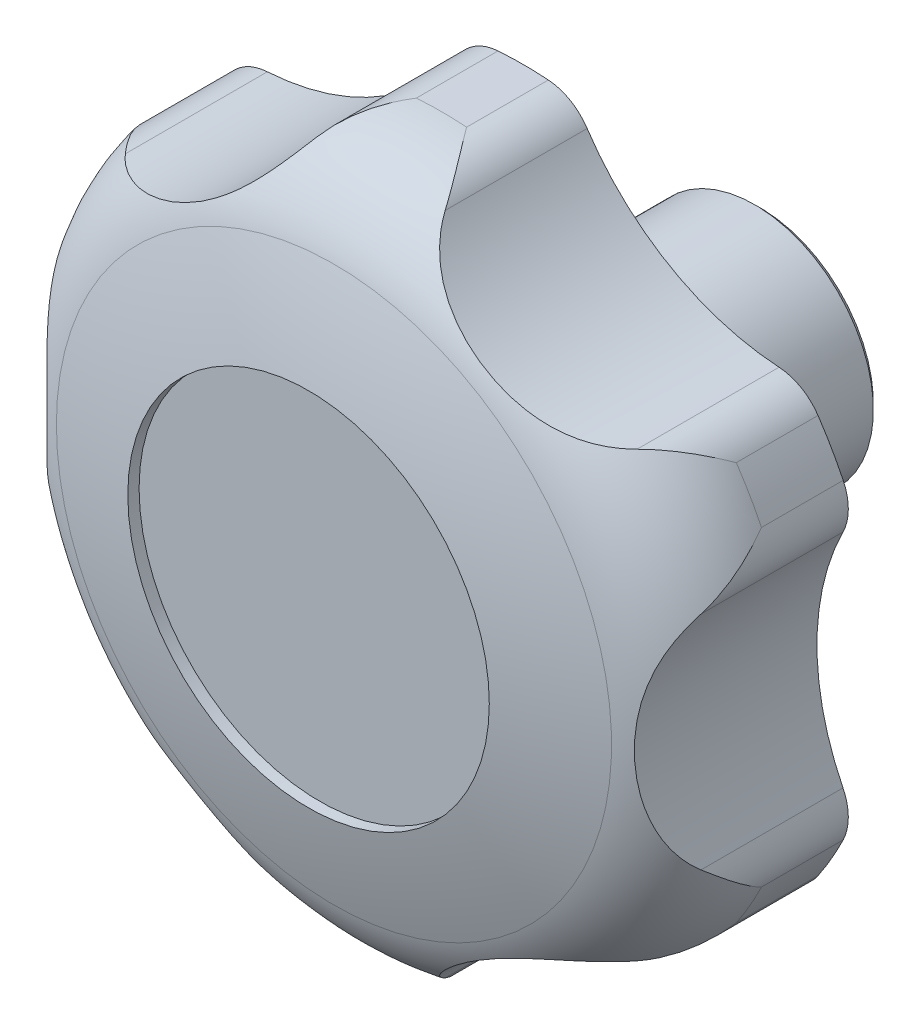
ISO-10303-21;
HEADER;
FILE_DESCRIPTION(('STEP AP214'),'2;1');
FILE_NAME('part.step','',(''),(''),'','','');
FILE_SCHEMA(('AUTOMOTIVE_DESIGN { 1 0 10303 214 1 1 1 1 }'));
ENDSEC;
DATA;
#1=APPLICATION_CONTEXT('core data for automotive mechanical design processes');
#2=APPLICATION_PROTOCOL_DEFINITION('international standard','automotive_design',2000,#1);
#3=PRODUCT_CONTEXT('',#1,'mechanical');
#4=PRODUCT('Part','Part','',(#3));
#5=PRODUCT_RELATED_PRODUCT_CATEGORY('part','',(#4));
#6=PRODUCT_DEFINITION_FORMATION('','',#4);
#7=PRODUCT_DEFINITION_CONTEXT('part definition',#1,'design');
#8=PRODUCT_DEFINITION('design','',#6,#7);
#9=PRODUCT_DEFINITION_SHAPE('','',#8);
#10=(LENGTH_UNIT() NAMED_UNIT(*) SI_UNIT(.MILLI.,.METRE.));
#11=(NAMED_UNIT(*) PLANE_ANGLE_UNIT() SI_UNIT($,.RADIAN.));
#12=(NAMED_UNIT(*) SI_UNIT($,.STERADIAN.) SOLID_ANGLE_UNIT());
#13=UNCERTAINTY_MEASURE_WITH_UNIT(LENGTH_MEASURE(1.E-05),#10,'distance_accuracy_value','');
#14=(GEOMETRIC_REPRESENTATION_CONTEXT(3) GLOBAL_UNCERTAINTY_ASSIGNED_CONTEXT((#13)) GLOBAL_UNIT_ASSIGNED_CONTEXT((#10,
#11,#12)) REPRESENTATION_CONTEXT('',''));
#15=CARTESIAN_POINT('',(0.,0.,0.));
#16=DIRECTION('',(0.,0.,1.));
#17=DIRECTION('',(1.,0.,0.));
#18=AXIS2_PLACEMENT_3D('',#15,#16,#17);
#19=CARTESIAN_POINT('',(0.,0.,48.6287321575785));
#20=DIRECTION('',(0.,0.,1.));
#21=DIRECTION('',(-1.,0.,0.));
#22=AXIS2_PLACEMENT_3D('',#19,#20,#21);
#23=CYLINDRICAL_SURFACE('',#22,31.5);
#24=CARTESIAN_POINT('',(0.,0.,21.));
#25=DIRECTION('',(0.,0.,1.));
#26=DIRECTION('',(-1.,0.,0.));
#27=AXIS2_PLACEMENT_3D('',#24,#25,#26);
#28=CIRCLE('',#27,31.5);
#29=CARTESIAN_POINT('',(26.0979777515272,-17.639318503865,21.));
#30=VERTEX_POINT('',#29);
#31=CARTESIAN_POINT('',(28.3250868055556,-13.7818524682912,21.));
#32=VERTEX_POINT('',#31);
#33=EDGE_CURVE('E444',#30,#32,#28,.T.);
#34=ORIENTED_EDGE('',*,*,#33,.T.);
#35=DIRECTION('',(0.,0.,1.));
#36=VECTOR('',#35,1.);
#37=CARTESIAN_POINT('',(28.3250868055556,-13.7818524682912,0.));
#38=LINE('',#37,#36);
#39=CARTESIAN_POINT('',(28.3250868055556,-13.7818524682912,28.232767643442));
#40=VERTEX_POINT('',#39);
#41=EDGE_CURVE('E182',#32,#40,#38,.T.);
#42=ORIENTED_EDGE('',*,*,#41,.T.);
#43=CARTESIAN_POINT('',(0.,0.,28.232767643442));
#44=DIRECTION('',(0.,0.,1.));
#45=DIRECTION('',(-1.,0.,0.));
#46=AXIS2_PLACEMENT_3D('',#43,#44,#45);
#47=CIRCLE('',#46,31.5);
#48=CARTESIAN_POINT('',(26.0979777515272,-17.639318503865,28.232767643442));
#49=VERTEX_POINT('',#48);
#50=EDGE_CURVE('E198',#49,#40,#47,.T.);
#51=ORIENTED_EDGE('',*,*,#50,.F.);
#52=DIRECTION('',(0.,0.,1.));
#53=VECTOR('',#52,1.);
#54=CARTESIAN_POINT('',(26.0979777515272,-17.639318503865,0.));
#55=LINE('',#54,#53);
#56=EDGE_CURVE('E522',#30,#49,#55,.T.);
#57=ORIENTED_EDGE('',*,*,#56,.F.);
#58=EDGE_LOOP('',(#34,#42,#51,#57));
#59=FACE_BOUND('',#58,.T.);
#60=ADVANCED_FACE('F14',(#59),#23,.T.);
#61=CARTESIAN_POINT('',(-2.22710905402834,-31.421170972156,21.));
#62=VERTEX_POINT('',#61);
#63=CARTESIAN_POINT('',(2.22710905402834,-31.421170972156,21.));
#64=VERTEX_POINT('',#63);
#65=EDGE_CURVE('E447',#62,#64,#28,.T.);
#66=ORIENTED_EDGE('',*,*,#65,.T.);
#67=DIRECTION('',(0.,0.,1.));
#68=VECTOR('',#67,1.);
#69=CARTESIAN_POINT('',(2.22710905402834,-31.421170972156,0.));
#70=LINE('',#69,#68);
#71=CARTESIAN_POINT('',(2.22710905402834,-31.421170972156,28.232767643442));
#72=VERTEX_POINT('',#71);
#73=EDGE_CURVE('E528',#64,#72,#70,.T.);
#74=ORIENTED_EDGE('',*,*,#73,.T.);
#75=CARTESIAN_POINT('',(-2.22710905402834,-31.421170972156,28.232767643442));
#76=VERTEX_POINT('',#75);
#77=EDGE_CURVE('E458',#76,#72,#47,.T.);
#78=ORIENTED_EDGE('',*,*,#77,.F.);
#79=DIRECTION('',(0.,0.,1.));
#80=VECTOR('',#79,1.);
#81=CARTESIAN_POINT('',(-2.22710905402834,-31.421170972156,0.));
#82=LINE('',#81,#80);
#83=EDGE_CURVE('E531',#62,#76,#82,.T.);
#84=ORIENTED_EDGE('',*,*,#83,.F.);
#85=EDGE_LOOP('',(#66,#74,#78,#84));
#86=FACE_BOUND('',#85,.T.);
#87=ADVANCED_FACE('F410',(#86),#23,.T.);
#88=CARTESIAN_POINT('',(-28.3250868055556,-13.7818524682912,21.));
#89=VERTEX_POINT('',#88);
#90=CARTESIAN_POINT('',(-26.0979777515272,-17.639318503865,21.));
#91=VERTEX_POINT('',#90);
#92=EDGE_CURVE('E450',#89,#91,#28,.T.);
#93=ORIENTED_EDGE('',*,*,#92,.T.);
#94=DIRECTION('',(0.,0.,1.));
#95=VECTOR('',#94,1.);
#96=CARTESIAN_POINT('',(-26.0979777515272,-17.639318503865,0.));
#97=LINE('',#96,#95);
#98=CARTESIAN_POINT('',(-26.0979777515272,-17.639318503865,28.232767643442));
#99=VERTEX_POINT('',#98);
#100=EDGE_CURVE('E539',#91,#99,#97,.T.);
#101=ORIENTED_EDGE('',*,*,#100,.T.);
#102=CARTESIAN_POINT('',(-28.3250868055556,-13.7818524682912,28.232767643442));
#103=VERTEX_POINT('',#102);
#104=EDGE_CURVE('E454',#103,#99,#47,.T.);
#105=ORIENTED_EDGE('',*,*,#104,.F.);
#106=DIRECTION('',(0.,0.,1.));
#107=VECTOR('',#106,1.);
#108=CARTESIAN_POINT('',(-28.3250868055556,-13.7818524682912,0.));
#109=LINE('',#108,#107);
#110=EDGE_CURVE('E542',#89,#103,#109,.T.);
#111=ORIENTED_EDGE('',*,*,#110,.F.);
#112=EDGE_LOOP('',(#93,#101,#105,#111));
#113=FACE_BOUND('',#112,.T.);
#114=ADVANCED_FACE('F418',(#113),#23,.T.);
#115=CARTESIAN_POINT('',(-26.0979777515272,17.639318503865,21.));
#116=VERTEX_POINT('',#115);
#117=CARTESIAN_POINT('',(-28.3250868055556,13.7818524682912,21.));
#118=VERTEX_POINT('',#117);
#119=EDGE_CURVE('E449',#116,#118,#28,.T.);
#120=ORIENTED_EDGE('',*,*,#119,.T.);
#121=DIRECTION('',(0.,0.,1.));
#122=VECTOR('',#121,1.);
#123=CARTESIAN_POINT('',(-28.3250868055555,13.7818524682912,0.));
#124=LINE('',#123,#122);
#125=CARTESIAN_POINT('',(-28.3250868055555,13.7818524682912,28.232767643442));
#126=VERTEX_POINT('',#125);
#127=EDGE_CURVE('E37',#118,#126,#124,.T.);
#128=ORIENTED_EDGE('',*,*,#127,.T.);
#129=CARTESIAN_POINT('',(-26.0979777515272,17.639318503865,28.232767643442));
#130=VERTEX_POINT('',#129);
#131=EDGE_CURVE('E453',#130,#126,#47,.T.);
#132=ORIENTED_EDGE('',*,*,#131,.F.);
#133=DIRECTION('',(0.,0.,1.));
#134=VECTOR('',#133,1.);
#135=CARTESIAN_POINT('',(-26.0979777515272,17.639318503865,0.));
#136=LINE('',#135,#134);
#137=EDGE_CURVE('E551',#116,#130,#136,.T.);
#138=ORIENTED_EDGE('',*,*,#137,.F.);
#139=EDGE_LOOP('',(#120,#128,#132,#138));
#140=FACE_BOUND('',#139,.T.);
#141=ADVANCED_FACE('F431',(#140),#23,.T.);
#142=CARTESIAN_POINT('',(2.22710905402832,31.4211709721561,21.));
#143=VERTEX_POINT('',#142);
#144=CARTESIAN_POINT('',(-2.22710905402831,31.4211709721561,21.));
#145=VERTEX_POINT('',#144);
#146=EDGE_CURVE('E445',#143,#145,#28,.T.);
#147=ORIENTED_EDGE('',*,*,#146,.T.);
#148=DIRECTION('',(0.,0.,1.));
#149=VECTOR('',#148,1.);
#150=CARTESIAN_POINT('',(-2.22710905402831,31.4211709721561,0.));
#151=LINE('',#150,#149);
#152=CARTESIAN_POINT('',(-2.22710905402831,31.4211709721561,28.232767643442));
#153=VERTEX_POINT('',#152);
#154=EDGE_CURVE('E559',#145,#153,#151,.T.);
#155=ORIENTED_EDGE('',*,*,#154,.T.);
#156=CARTESIAN_POINT('',(2.22710905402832,31.4211709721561,28.232767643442));
#157=VERTEX_POINT('',#156);
#158=EDGE_CURVE('E859',#157,#153,#47,.T.);
#159=ORIENTED_EDGE('',*,*,#158,.F.);
#160=DIRECTION('',(0.,0.,1.));
#161=VECTOR('',#160,1.);
#162=CARTESIAN_POINT('',(2.22710905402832,31.4211709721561,0.));
#163=LINE('',#162,#161);
#164=EDGE_CURVE('E562',#143,#157,#163,.T.);
#165=ORIENTED_EDGE('',*,*,#164,.F.);
#166=EDGE_LOOP('',(#147,#155,#159,#165));
#167=FACE_BOUND('',#166,.T.);
#168=ADVANCED_FACE('F422',(#167),#23,.T.);
#169=CARTESIAN_POINT('',(28.3250868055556,13.7818524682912,21.));
#170=VERTEX_POINT('',#169);
#171=CARTESIAN_POINT('',(26.0979777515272,17.639318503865,21.));
#172=VERTEX_POINT('',#171);
#173=EDGE_CURVE('E437',#170,#172,#28,.T.);
#174=ORIENTED_EDGE('',*,*,#173,.T.);
#175=DIRECTION('',(0.,0.,1.));
#176=VECTOR('',#175,1.);
#177=CARTESIAN_POINT('',(26.0979777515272,17.639318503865,0.));
#178=LINE('',#177,#176);
#179=CARTESIAN_POINT('',(26.0979777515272,17.639318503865,28.232767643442));
#180=VERTEX_POINT('',#179);
#181=EDGE_CURVE('E439',#172,#180,#178,.T.);
#182=ORIENTED_EDGE('',*,*,#181,.T.);
#183=CARTESIAN_POINT('',(28.3250868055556,13.7818524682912,28.232767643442));
#184=VERTEX_POINT('',#183);
#185=EDGE_CURVE('E861',#184,#180,#47,.T.);
#186=ORIENTED_EDGE('',*,*,#185,.F.);
#187=DIRECTION('',(0.,0.,1.));
#188=VECTOR('',#187,1.);
#189=CARTESIAN_POINT('',(28.3250868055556,13.7818524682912,0.));
#190=LINE('',#189,#188);
#191=EDGE_CURVE('E441',#170,#184,#190,.T.);
#192=ORIENTED_EDGE('',*,*,#191,.F.);
#193=EDGE_LOOP('',(#174,#182,#186,#192));
#194=FACE_BOUND('',#193,.T.);
#195=ADVANCED_FACE('F412',(#194),#23,.T.);
#196=CARTESIAN_POINT('',(0.,0.,48.6287321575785));
#197=DIRECTION('',(0.,0.,1.));
#198=DIRECTION('',(-1.,0.,0.));
#199=AXIS2_PLACEMENT_3D('',#196,#197,#198);
#200=CYLINDRICAL_SURFACE('',#199,13.);
#201=CARTESIAN_POINT('',(0.,0.,21.));
#202=DIRECTION('',(0.,0.,1.));
#203=DIRECTION('',(-1.,0.,0.));
#204=AXIS2_PLACEMENT_3D('',#201,#202,#203);
#205=CIRCLE('',#204,13.);
#206=CARTESIAN_POINT('',(-13.,0.,21.));
#207=VERTEX_POINT('',#206);
#208=EDGE_CURVE('E473',#207,#207,#205,.T.);
#209=ORIENTED_EDGE('',*,*,#208,.F.);
#210=EDGE_LOOP('',(#209));
#211=FACE_BOUND('',#210,.T.);
#212=CARTESIAN_POINT('',(0.,0.,19.));
#213=DIRECTION('',(0.,0.,1.));
#214=DIRECTION('',(-1.,0.,0.));
#215=AXIS2_PLACEMENT_3D('',#212,#213,#214);
#216=CIRCLE('',#215,13.);
#217=CARTESIAN_POINT('',(-13.,0.,19.));
#218=VERTEX_POINT('',#217);
#219=EDGE_CURVE('E470',#218,#218,#216,.T.);
#220=ORIENTED_EDGE('',*,*,#219,.T.);
#221=EDGE_LOOP('',(#220));
#222=FACE_BOUND('',#221,.T.);
#223=ADVANCED_FACE('F16',(#211,#222),#200,.T.);
#224=CARTESIAN_POINT('',(0.,10.5,19.));
#225=DIRECTION('',(0.,0.,1.));
#226=DIRECTION('',(-1.,0.,0.));
#227=AXIS2_PLACEMENT_3D('',#224,#225,#226);
#228=PLANE('',#227);
#229=ORIENTED_EDGE('',*,*,#219,.F.);
#230=EDGE_LOOP('',(#229));
#231=FACE_BOUND('',#230,.T.);
#232=CARTESIAN_POINT('',(0.,0.,19.));
#233=DIRECTION('',(0.,0.,1.));
#234=DIRECTION('',(-1.,0.,0.));
#235=AXIS2_PLACEMENT_3D('',#232,#233,#234);
#236=CIRCLE('',#235,10.5);
#237=CARTESIAN_POINT('',(-10.5,0.,19.));
#238=VERTEX_POINT('',#237);
#239=EDGE_CURVE('E467',#238,#238,#236,.T.);
#240=ORIENTED_EDGE('',*,*,#239,.T.);
#241=EDGE_LOOP('',(#240));
#242=FACE_BOUND('',#241,.T.);
#243=ADVANCED_FACE('F429',(#231,#242),#228,.F.);
#244=CARTESIAN_POINT('',(0.,0.,48.6287321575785));
#245=DIRECTION('',(0.,0.,1.));
#246=DIRECTION('',(-1.,0.,0.));
#247=AXIS2_PLACEMENT_3D('',#244,#245,#246);
#248=CYLINDRICAL_SURFACE('',#247,10.5);
#249=CARTESIAN_POINT('',(0.,0.,0.5));
#250=DIRECTION('',(0.,0.,1.));
#251=DIRECTION('',(-1.,0.,0.));
#252=AXIS2_PLACEMENT_3D('',#249,#250,#251);
#253=CIRCLE('',#252,10.5);
#254=CARTESIAN_POINT('',(-10.5,0.,0.5));
#255=VERTEX_POINT('',#254);
#256=EDGE_CURVE('E464',#255,#255,#253,.T.);
#257=ORIENTED_EDGE('',*,*,#256,.T.);
#258=EDGE_LOOP('',(#257));
#259=FACE_BOUND('',#258,.T.);
#260=ORIENTED_EDGE('',*,*,#239,.F.);
#261=EDGE_LOOP('',(#260));
#262=FACE_BOUND('',#261,.T.);
#263=ADVANCED_FACE('F594',(#259,#262),#248,.T.);
#264=CARTESIAN_POINT('',(0.,0.,0.));
#265=DIRECTION('',(0.,0.,1.));
#266=DIRECTION('',(-1.,0.,0.));
#267=AXIS2_PLACEMENT_3D('',#264,#265,#266);
#268=CONICAL_SURFACE('',#267,10.,0.785398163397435);
#269=ORIENTED_EDGE('',*,*,#256,.F.);
#270=EDGE_LOOP('',(#269));
#271=FACE_BOUND('',#270,.T.);
#272=CARTESIAN_POINT('',(0.,0.,0.));
#273=DIRECTION('',(0.,0.,1.));
#274=DIRECTION('',(-1.,0.,0.));
#275=AXIS2_PLACEMENT_3D('',#272,#273,#274);
#276=CIRCLE('',#275,10.);
#277=CARTESIAN_POINT('',(-10.,0.,0.));
#278=VERTEX_POINT('',#277);
#279=EDGE_CURVE('E461',#278,#278,#276,.T.);
#280=ORIENTED_EDGE('',*,*,#279,.T.);
#281=EDGE_LOOP('',(#280));
#282=FACE_BOUND('',#281,.T.);
#283=ADVANCED_FACE('F589',(#271,#282),#268,.T.);
#284=CARTESIAN_POINT('',(0.,0.,0.));
#285=DIRECTION('',(0.,0.,1.));
#286=DIRECTION('',(-1.,0.,0.));
#287=AXIS2_PLACEMENT_3D('',#284,#285,#286);
#288=PLANE('',#287);
#289=CARTESIAN_POINT('',(0.,0.,0.));
#290=DIRECTION('',(0.,0.,-1.));
#291=DIRECTION('',(1.,0.,0.));
#292=AXIS2_PLACEMENT_3D('',#289,#290,#291);
#293=CIRCLE('',#292,6.);
#294=CARTESIAN_POINT('',(6.,0.,0.));
#295=VERTEX_POINT('',#294);
#296=EDGE_CURVE('E191',#295,#295,#293,.T.);
#297=ORIENTED_EDGE('',*,*,#296,.F.);
#298=EDGE_LOOP('',(#297));
#299=FACE_BOUND('',#298,.T.);
#300=ORIENTED_EDGE('',*,*,#279,.F.);
#301=EDGE_LOOP('',(#300));
#302=FACE_BOUND('',#301,.T.);
#303=ADVANCED_FACE('F585',(#299,#302),#288,.F.);
#304=CARTESIAN_POINT('',(0.,0.,-38.3836717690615));
#305=DIRECTION('',(-1.,0.,0.));
#306=DIRECTION('',(0.,0.,-1.));
#307=AXIS2_PLACEMENT_3D('',#304,#305,#306);
#308=SPHERICAL_SURFACE('',#307,79.9999999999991);
#309=CARTESIAN_POINT('',(0.,0.,-38.3836717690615));
#310=DIRECTION('',(0.,0.,1.));
#311=DIRECTION('',(-1.,0.,0.));
#312=AXIS2_PLACEMENT_3D('',#309,#310,#311);
#313=SPHERICAL_SURFACE('',#312,79.9999999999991);
#314=CARTESIAN_POINT('',(0.,0.,37.7494018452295));
#315=DIRECTION('',(0.,0.,1.));
#316=DIRECTION('',(-1.,0.,0.));
#317=AXIS2_PLACEMENT_3D('',#314,#315,#316);
#318=CIRCLE('',#317,24.5714285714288);
#319=CARTESIAN_POINT('',(-24.5714285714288,0.,37.7494018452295));
#320=VERTEX_POINT('',#319);
#321=EDGE_CURVE('E457',#320,#320,#318,.T.);
#322=ORIENTED_EDGE('',*,*,#321,.T.);
#323=EDGE_LOOP('',(#322));
#324=FACE_BOUND('',#323,.T.);
#325=CARTESIAN_POINT('',(0.,0.,40.));
#326=DIRECTION('',(0.,0.,1.));
#327=DIRECTION('',(-1.,0.,0.));
#328=AXIS2_PLACEMENT_3D('',#325,#326,#327);
#329=CIRCLE('',#328,16.);
#330=CARTESIAN_POINT('',(-16.,0.,40.));
#331=VERTEX_POINT('',#330);
#332=EDGE_CURVE('E199',#331,#331,#329,.T.);
#333=ORIENTED_EDGE('',*,*,#332,.F.);
#334=EDGE_LOOP('',(#333));
#335=FACE_BOUND('',#334,.T.);
#336=ADVANCED_FACE('F588',(#324,#335),#313,.T.);
#337=CARTESIAN_POINT('',(0.,0.,28.232767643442));
#338=DIRECTION('',(0.,0.,1.));
#339=DIRECTION('',(-1.,0.,0.));
#340=AXIS2_PLACEMENT_3D('',#337,#338,#339);
#341=TOROIDAL_SURFACE('',#340,21.5,10.);
#342=CARTESIAN_POINT('',(26.0979777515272,-17.639318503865,28.232767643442));
#343=CARTESIAN_POINT('',(26.0957873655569,-17.6425592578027,28.2381661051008));
#344=CARTESIAN_POINT('',(26.0935927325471,-17.6457971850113,28.2435646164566));
#345=CARTESIAN_POINT('',(25.9715048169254,-17.8254189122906,28.5433082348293));
#346=CARTESIAN_POINT('',(25.8390070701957,-17.9933768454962,28.8377892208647));
#347=CARTESIAN_POINT('',(25.5505586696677,-18.3097082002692,29.4258443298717));
#348=CARTESIAN_POINT('',(25.3945993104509,-18.4580743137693,29.7194180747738));
#349=CARTESIAN_POINT('',(25.060613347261,-18.7326906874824,30.3051183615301));
#350=CARTESIAN_POINT('',(24.8825534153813,-18.8589068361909,30.5972420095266));
#351=CARTESIAN_POINT('',(24.5064415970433,-19.085843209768,31.1782260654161));
#352=CARTESIAN_POINT('',(24.3084021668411,-19.1865791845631,31.4670883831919));
#353=CARTESIAN_POINT('',(23.8777210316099,-19.3661170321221,32.0631220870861));
#354=CARTESIAN_POINT('',(23.643582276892,-19.4425638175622,32.3699417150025));
#355=CARTESIAN_POINT('',(23.2789979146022,-19.5283534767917,32.8243186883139));
#356=CARTESIAN_POINT('',(23.1553286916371,-19.5521302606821,32.9747024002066));
#357=CARTESIAN_POINT('',(22.9038337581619,-19.5894090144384,33.2733876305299));
#358=CARTESIAN_POINT('',(22.7760057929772,-19.6029053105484,33.4216879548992));
#359=CARTESIAN_POINT('',(22.6463394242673,-19.610904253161,33.5687610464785));
#360=B_SPLINE_CURVE_WITH_KNOTS('',3,(#342,#343,#344,#345,#346,#347,#348,#349,#350,#351,#352,
#353,#354,#355,#356,#357,#358,#359),.UNSPECIFIED.,.F.,.F.,(4,2,2,2,2,2,2,2,4),(0.,
0.0200000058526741,1.11045859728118,2.20132280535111,3.29385250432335,4.3857052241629,
5.56362960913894,6.15179569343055,6.74028614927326),.UNSPECIFIED.);
#361=CARTESIAN_POINT('',(22.6465394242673,-19.610891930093,33.568534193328));
#362=VERTEX_POINT('',#361);
#363=EDGE_CURVE('E200',#49,#362,#360,.T.);
#364=ORIENTED_EDGE('',*,*,#363,.F.);
#365=ORIENTED_EDGE('',*,*,#50,.T.);
#366=CARTESIAN_POINT('',(28.3067007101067,-9.8068324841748,33.568787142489));
#367=CARTESIAN_POINT('',(28.3508912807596,-9.89556849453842,33.4565618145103));
#368=CARTESIAN_POINT('',(28.3917729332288,-9.98498886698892,33.3436125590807));
#369=CARTESIAN_POINT('',(28.4670914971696,-10.1648549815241,33.1164224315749));
#370=CARTESIAN_POINT('',(28.5015295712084,-10.2553005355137,33.0021817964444));
#371=CARTESIAN_POINT('',(28.5953953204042,-10.5275208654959,32.6579333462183));
#372=CARTESIAN_POINT('',(28.6454651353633,-10.7103641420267,32.426166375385));
#373=CARTESIAN_POINT('',(28.721810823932,-11.076055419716,31.9595965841));
#374=CARTESIAN_POINT('',(28.7481337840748,-11.2589026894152,31.7248007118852));
#375=CARTESIAN_POINT('',(28.7783405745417,-11.622978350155,31.2525284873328));
#376=CARTESIAN_POINT('',(28.7822209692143,-11.804206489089,31.0150517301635));
#377=CARTESIAN_POINT('',(28.7634739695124,-12.2980890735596,30.3589883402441));
#378=CARTESIAN_POINT('',(28.7187582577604,-12.607264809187,29.9382841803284));
#379=CARTESIAN_POINT('',(28.5687108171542,-13.206004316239,29.0945771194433));
#380=CARTESIAN_POINT('',(28.4634632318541,-13.4955946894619,28.6715782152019));
#381=CARTESIAN_POINT('',(28.3285049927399,-13.7748156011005,28.2435645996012));
#382=CARTESIAN_POINT('',(28.3267981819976,-13.7783351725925,28.2381660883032));
#383=CARTESIAN_POINT('',(28.3250868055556,-13.7818524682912,28.232767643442));
#384=B_SPLINE_CURVE_WITH_KNOTS('',3,(#366,#367,#368,#369,#370,#371,#372,#373,#374,#375,#376,
#377,#378,#379,#380,#381,#382,#383),.UNSPECIFIED.,.F.,.F.,(4,2,2,2,2,2,2,2,4),(0.,
0.449123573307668,0.89816603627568,1.79532231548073,2.69069573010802,3.58620621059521,
5.15403517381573,6.71968999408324,6.73968999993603),.UNSPECIFIED.);
#385=CARTESIAN_POINT('',(28.3068003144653,-9.8070324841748,33.568534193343));
#386=VERTEX_POINT('',#385);
#387=EDGE_CURVE('E186',#386,#40,#384,.T.);
#388=ORIENTED_EDGE('',*,*,#387,.F.);
#389=CARTESIAN_POINT('',(28.306899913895,-9.80723248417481,33.568281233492));
#390=CARTESIAN_POINT('',(28.2673881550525,-9.72789258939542,33.6686385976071));
#391=CARTESIAN_POINT('',(28.227286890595,-9.64616596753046,33.7668454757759));
#392=CARTESIAN_POINT('',(28.1461835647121,-9.47811588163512,33.9588369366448));
#393=CARTESIAN_POINT('',(28.1051815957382,-9.39179288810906,34.0526219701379));
#394=CARTESIAN_POINT('',(27.9813412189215,-9.12640847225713,34.3269450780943));
#395=CARTESIAN_POINT('',(27.8975600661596,-8.94071625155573,34.5007229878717));
#396=CARTESIAN_POINT('',(27.7306770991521,-8.55559108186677,34.8277600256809));
#397=CARTESIAN_POINT('',(27.6475773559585,-8.35632234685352,34.9812149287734));
#398=CARTESIAN_POINT('',(27.4831867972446,-7.94415498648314,35.2697558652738));
#399=CARTESIAN_POINT('',(27.4018963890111,-7.73125333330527,35.4048377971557));
#400=CARTESIAN_POINT('',(27.2432790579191,-7.29467382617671,35.656528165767));
#401=CARTESIAN_POINT('',(27.1659377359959,-7.07104190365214,35.7732075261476));
#402=CARTESIAN_POINT('',(27.0164001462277,-6.61410095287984,35.9895642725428));
#403=CARTESIAN_POINT('',(26.9442035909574,-6.38079246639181,36.0892426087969));
#404=CARTESIAN_POINT('',(26.8060036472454,-5.90558258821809,36.2729593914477));
#405=CARTESIAN_POINT('',(26.7400171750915,-5.66366006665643,36.3569556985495));
#406=CARTESIAN_POINT('',(26.6154160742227,-5.173356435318,36.510259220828));
#407=CARTESIAN_POINT('',(26.5568025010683,-4.92497440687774,36.5795643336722));
#408=CARTESIAN_POINT('',(26.4181661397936,-4.28729101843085,36.738696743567));
#409=CARTESIAN_POINT('',(26.3437188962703,-3.89445767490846,36.8193385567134));
#410=CARTESIAN_POINT('',(26.2158958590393,-3.10074997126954,36.9533643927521));
#411=CARTESIAN_POINT('',(26.1625301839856,-2.69987184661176,37.006735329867));
#412=CARTESIAN_POINT('',(26.0777773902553,-1.89243908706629,37.0898241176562));
#413=CARTESIAN_POINT('',(26.0464425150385,-1.48587327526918,37.1194857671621));
#414=CARTESIAN_POINT('',(26.0064401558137,-0.670716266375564,37.1571359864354));
#415=CARTESIAN_POINT('',(25.9977694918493,-0.262125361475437,37.1651275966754));
#416=CARTESIAN_POINT('',(26.0032673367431,0.564334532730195,37.1600141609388));
#417=CARTESIAN_POINT('',(26.01797448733,0.982197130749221,37.146411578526));
#418=CARTESIAN_POINT('',(26.0710365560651,1.81513174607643,37.0960704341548));
#419=CARTESIAN_POINT('',(26.1093958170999,2.23020323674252,37.0593276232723));
#420=CARTESIAN_POINT('',(26.2090070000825,3.05355191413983,36.9600301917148));
#421=CARTESIAN_POINT('',(26.2702065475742,3.46184242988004,36.8975345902));
#422=CARTESIAN_POINT('',(26.4142334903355,4.26876333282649,36.7425858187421));
#423=CARTESIAN_POINT('',(26.4970492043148,4.66739881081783,36.6501488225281));
#424=CARTESIAN_POINT('',(26.65189721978,5.32280567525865,36.4661289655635));
#425=CARTESIAN_POINT('',(26.7186645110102,5.58351647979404,36.3840627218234));
#426=CARTESIAN_POINT('',(26.8599386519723,6.09659869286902,36.2024669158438));
#427=CARTESIAN_POINT('',(26.9344431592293,6.34897259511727,36.1029426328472));
#428=CARTESIAN_POINT('',(27.0896194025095,6.84271708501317,35.8852972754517));
#429=CARTESIAN_POINT('',(27.1702731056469,7.08411676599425,35.7672295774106));
#430=CARTESIAN_POINT('',(27.336207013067,7.55445583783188,35.5111726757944));
#431=CARTESIAN_POINT('',(27.4214863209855,7.78339762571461,35.3731873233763));
#432=CARTESIAN_POINT('',(27.5743147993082,8.17463300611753,35.1113840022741));
#433=CARTESIAN_POINT('',(27.6413411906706,8.33998254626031,34.9918111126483));
#434=CARTESIAN_POINT('',(27.7758194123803,8.66099232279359,34.7405668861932));
#435=CARTESIAN_POINT('',(27.8432711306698,8.81665500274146,34.6088986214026));
#436=CARTESIAN_POINT('',(27.9779423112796,9.11836971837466,34.3326466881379));
#437=CARTESIAN_POINT('',(28.0451570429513,9.26434887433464,34.1879809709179));
#438=CARTESIAN_POINT('',(28.177732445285,9.54473083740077,33.8868532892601));
#439=CARTESIAN_POINT('',(28.2430918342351,9.67912576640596,33.730383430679));
#440=CARTESIAN_POINT('',(28.306899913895,9.807232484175,33.5682812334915));
#441=B_SPLINE_CURVE_WITH_KNOTS('',3,(#389,#390,#391,#392,#393,#394,#395,#396,#397,#398,#399,
#400,#401,#402,#403,#404,#405,#406,#407,#408,#409,#410,#411,#412,#413,#414,#415,#416,#417,#418,
#419,#420,#421,#422,#423,#424,#425,#426,#427,#428,#429,#430,#431,#432,#433,#434,#435,#436,#437,
#438,#439,#440),.UNSPECIFIED.,.F.,.F.,(4,2,2,2,2,2,2,2,2,2,2,2,2,2,2,2,2,2,2,2,2,2,2,2,2,4),(0.,
0.401597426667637,0.803153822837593,1.60518118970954,2.39881165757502,3.19261900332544,
3.98328802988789,4.77391284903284,5.56663251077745,6.35946553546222,7.58127502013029,
8.8036702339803,10.028954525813,11.2540668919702,12.5078182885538,13.7617999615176,
15.0129236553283,16.2633726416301,17.106781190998,17.9499351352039,18.7907051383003,
19.6313127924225,20.2751395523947,20.9188032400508,21.5668619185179,22.2153579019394),.UNSPECIFIED.);
#442=CARTESIAN_POINT('',(28.3068003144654,9.80703248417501,33.5685341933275));
#443=VERTEX_POINT('',#442);
#444=EDGE_CURVE('E174',#386,#443,#441,.T.);
#445=ORIENTED_EDGE('',*,*,#444,.T.);
#446=CARTESIAN_POINT('',(28.3250868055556,13.7818524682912,28.232767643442));
#447=CARTESIAN_POINT('',(28.3267981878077,13.7783351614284,28.2381661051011));
#448=CARTESIAN_POINT('',(28.3285049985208,13.774815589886,28.2435646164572));
#449=CARTESIAN_POINT('',(28.4230180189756,13.5792734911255,28.5433082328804));
#450=CARTESIAN_POINT('',(28.5022249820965,13.3805481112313,28.8377892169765));
#451=CARTESIAN_POINT('',(28.6319517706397,12.9725787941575,29.4258443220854));
#452=CARTESIAN_POINT('',(28.6824609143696,12.7633309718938,29.7194180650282));
#453=CARTESIAN_POINT('',(28.7532926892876,12.3367824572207,30.3051183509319));
#454=CARTESIAN_POINT('',(28.7735691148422,12.1194699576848,30.5972420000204));
#455=CARTESIAN_POINT('',(28.7820458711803,11.6802793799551,31.1782260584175));
#456=CARTESIAN_POINT('',(28.7702660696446,11.4584042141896,31.467088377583));
#457=CARTESIAN_POINT('',(28.7104093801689,10.9956509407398,32.0631266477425));
#458=CARTESIAN_POINT('',(28.6595438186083,10.7546538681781,32.3699507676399));
#459=CARTESIAN_POINT('',(28.5515451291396,10.3960144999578,32.8243342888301));
#460=CARTESIAN_POINT('',(28.5103008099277,10.2770236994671,32.9747201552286));
#461=CARTESIAN_POINT('',(28.416835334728,10.0405799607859,33.2734096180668));
#462=CARTESIAN_POINT('',(28.3646081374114,9.92312790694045,33.4217120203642));
#463=CARTESIAN_POINT('',(28.3067007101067,9.80683248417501,33.568787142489));
#464=B_SPLINE_CURVE_WITH_KNOTS('',3,(#446,#447,#448,#449,#450,#451,#452,#453,#454,#455,#456,
#457,#458,#459,#460,#461,#462,#463),.UNSPECIFIED.,.F.,.F.,(4,2,2,2,2,2,2,2,4),(0.,
0.020000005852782,1.1104585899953,2.20132279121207,3.29385249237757,4.38570522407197,
5.56364696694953,6.15182175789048,6.74032093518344),.UNSPECIFIED.);
#465=EDGE_CURVE('E181',#184,#443,#464,.T.);
#466=ORIENTED_EDGE('',*,*,#465,.F.);
#467=ORIENTED_EDGE('',*,*,#185,.T.);
#468=CARTESIAN_POINT('',(22.6463394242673,19.610904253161,33.5687610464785));
#469=CARTESIAN_POINT('',(22.7452824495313,19.6048058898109,33.4565353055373));
#470=CARTESIAN_POINT('',(22.8431636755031,19.5954997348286,33.3435856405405));
#471=CARTESIAN_POINT('',(23.036591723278,19.5707934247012,33.11639470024));
#472=CARTESIAN_POINT('',(23.132138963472,19.5553943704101,33.0021536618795));
#473=CARTESIAN_POINT('',(23.4148216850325,19.5005727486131,32.6579040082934));
#474=CARTESIAN_POINT('',(23.5982035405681,19.4525117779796,32.4261362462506));
#475=CARTESIAN_POINT('',(23.953074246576,19.3357813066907,31.9595649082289));
#476=CARTESIAN_POINT('',(24.1245860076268,19.2671529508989,31.7247682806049));
#477=CARTESIAN_POINT('',(24.4549878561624,19.1112728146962,31.2524945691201));
#478=CARTESIAN_POINT('',(24.613876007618,19.0240181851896,31.015017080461));
#479=CARTESIAN_POINT('',(25.0322121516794,18.7608413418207,30.3589586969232));
#480=CARTESIAN_POINT('',(25.2776039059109,18.5675303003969,29.938260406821));
#481=CARTESIAN_POINT('',(25.7210962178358,18.138220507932,29.0945651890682));
#482=CARTESIAN_POINT('',(25.9192618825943,17.9022813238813,28.6715722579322));
#483=CARTESIAN_POINT('',(26.0935927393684,17.6457971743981,28.2435645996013));
#484=CARTESIAN_POINT('',(26.09578737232,17.6425592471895,28.2381660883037));
#485=CARTESIAN_POINT('',(26.0979777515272,17.639318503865,28.232767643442));
#486=B_SPLINE_CURVE_WITH_KNOTS('',3,(#468,#469,#470,#471,#472,#473,#474,#475,#476,#477,#478,
#479,#480,#481,#482,#483,#484,#485),.UNSPECIFIED.,.F.,.F.,(4,2,2,2,2,2,2,2,4),(0.,
0.449124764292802,0.898168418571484,1.79532709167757,2.6907028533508,3.58621567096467,
5.15402250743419,6.71965525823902,6.73965526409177),.UNSPECIFIED.);
#487=CARTESIAN_POINT('',(22.6465394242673,19.610891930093,33.5685341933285));
#488=VERTEX_POINT('',#487);
#489=EDGE_CURVE('E250',#488,#180,#486,.T.);
#490=ORIENTED_EDGE('',*,*,#489,.F.);
#491=CARTESIAN_POINT('',(22.6467394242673,19.6108796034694,33.568307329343));
#492=CARTESIAN_POINT('',(22.5582725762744,19.6163314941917,33.6686645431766));
#493=CARTESIAN_POINT('',(22.4674440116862,19.622466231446,33.7668712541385));
#494=CARTESIAN_POINT('',(22.2813555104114,19.6362540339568,33.9588623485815));
#495=CARTESIAN_POINT('',(22.1860960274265,19.6439069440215,34.0526471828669));
#496=CARTESIAN_POINT('',(21.8943444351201,19.6693507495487,34.3269696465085));
#497=CARTESIAN_POINT('',(21.6916385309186,19.689640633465,34.5007470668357));
#498=CARTESIAN_POINT('',(21.2746666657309,19.737679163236,34.8277830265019));
#499=CARTESIAN_POINT('',(21.0605439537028,19.7653474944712,34.9812373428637));
#500=CARTESIAN_POINT('',(20.6213992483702,19.8290657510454,35.2697770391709));
#501=CARTESIAN_POINT('',(20.396374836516,19.8651175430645,35.4048583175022));
#502=CARTESIAN_POINT('',(19.938975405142,19.9460417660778,35.6565473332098));
#503=CARTESIAN_POINT('',(19.7066329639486,19.990878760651,35.7732259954));
#504=CARTESIAN_POINT('',(19.2361400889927,20.089847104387,35.9895813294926));
#505=CARTESIAN_POINT('',(18.9979899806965,20.1439779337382,36.0892589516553));
#506=CARTESIAN_POINT('',(18.5173447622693,20.2618995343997,36.2729743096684));
#507=CARTESIAN_POINT('',(18.2748398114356,20.3257155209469,36.356969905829));
#508=CARTESIAN_POINT('',(17.7879226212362,20.4629610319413,36.5102720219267));
#509=CARTESIAN_POINT('',(17.5435101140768,20.5363919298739,36.5795764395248));
#510=CARTESIAN_POINT('',(16.9219401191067,20.7351730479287,36.7387072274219));
#511=CARTESIAN_POINT('',(16.5445116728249,20.8671178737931,36.8193480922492));
#512=CARTESIAN_POINT('',(15.7932269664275,21.1532765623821,36.9533720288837));
#513=CARTESIAN_POINT('',(15.4193725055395,21.3075010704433,37.0067420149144));
#514=CARTESIAN_POINT('',(14.6777370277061,21.6378224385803,37.0898288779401));
#515=CARTESIAN_POINT('',(14.3099724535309,21.8139701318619,37.1194895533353));
#516=CARTESIAN_POINT('',(13.5840231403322,22.1869088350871,37.1571377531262));
#517=CARTESIAN_POINT('',(13.2258370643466,22.3836969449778,37.1651283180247));
#518=CARTESIAN_POINT('',(12.5128497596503,22.8016915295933,37.1600126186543));
#519=CARTESIAN_POINT('',(12.1583233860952,23.0233612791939,37.146408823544));
#520=CARTESIAN_POINT('',(11.4635114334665,23.4857850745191,37.0960650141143));
#521=CARTESIAN_POINT('',(11.1232284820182,23.7265426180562,37.0593207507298));
#522=CARTESIAN_POINT('',(10.4599932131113,24.2244861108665,36.9600200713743));
#523=CARTESIAN_POINT('',(10.1370031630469,24.4816333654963,36.8975226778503));
#524=CARTESIAN_POINT('',(9.51020318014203,25.0098279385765,36.7425698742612));
#525=CARTESIAN_POINT('',(9.20638299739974,25.2808676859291,36.6501306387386));
#526=CARTESIAN_POINT('',(8.71621052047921,25.7426742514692,36.466107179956));
#527=CARTESIAN_POINT('',(8.52381391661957,25.9308511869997,36.384039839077));
#528=CARTESIAN_POINT('',(8.15011259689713,26.3097378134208,36.202441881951));
#529=CARTESIAN_POINT('',(7.96880455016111,26.5004467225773,36.1029165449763));
#530=CARTESIAN_POINT('',(7.6188011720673,26.8817036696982,35.8852691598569));
#531=CARTESIAN_POINT('',(7.45007162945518,27.072250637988,35.7672004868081));
#532=CARTESIAN_POINT('',(7.12571667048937,27.4511209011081,35.5111417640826));
#533=CARTESIAN_POINT('',(6.97008873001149,27.6394446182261,35.3731555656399));
#534=CARTESIAN_POINT('',(6.70768734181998,27.9674120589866,35.1113519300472));
#535=CARTESIAN_POINT('',(6.59800591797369,28.1081310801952,34.9917796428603));
#536=CARTESIAN_POINT('',(6.38724675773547,28.3850929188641,34.7405369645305));
#537=CARTESIAN_POINT('',(6.28616684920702,28.521336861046,34.6088696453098));
#538=CARTESIAN_POINT('',(6.09221377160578,28.7888183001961,34.3326200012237));
#539=CARTESIAN_POINT('',(5.99940134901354,28.9200152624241,34.1879556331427));
#540=CARTESIAN_POINT('',(5.82287463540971,29.1750154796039,33.886831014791));
#541=CARTESIAN_POINT('',(5.73916652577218,29.2988136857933,33.7303628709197));
#542=CARTESIAN_POINT('',(5.66012837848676,29.4181244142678,33.5682625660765));
#543=B_SPLINE_CURVE_WITH_KNOTS('',3,(#491,#492,#493,#494,#495,#496,#497,#498,#499,#500,#501,
#502,#503,#504,#505,#506,#507,#508,#509,#510,#511,#512,#513,#514,#515,#516,#517,#518,#519,#520,
#521,#522,#523,#524,#525,#526,#527,#528,#529,#530,#531,#532,#533,#534,#535,#536,#537,#538,#539,
#540,#541,#542),.UNSPECIFIED.,.F.,.F.,(4,2,2,2,2,2,2,2,2,2,2,2,2,2,2,2,2,2,2,2,2,2,2,2,2,4),(0.,
0.401598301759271,0.80315557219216,1.60518467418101,2.39881681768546,3.19262584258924,
3.98329649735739,4.7739229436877,5.56664425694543,6.35947893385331,7.58129241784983,
8.80369163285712,10.0289799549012,11.2540963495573,12.507851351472,13.7618366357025,
15.0129638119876,16.2634162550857,17.1068205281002,17.9499701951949,18.7907359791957,
19.6313394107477,20.2751571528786,20.9188118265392,21.5668612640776,22.2153479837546),.UNSPECIFIED.);
#544=CARTESIAN_POINT('',(5.66026089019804,29.4179244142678,33.5685341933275));
#545=VERTEX_POINT('',#544);
#546=EDGE_CURVE('E256',#488,#545,#543,.T.);
#547=ORIENTED_EDGE('',*,*,#546,.T.);
#548=CARTESIAN_POINT('',(2.22710905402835,31.4211709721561,28.232767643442));
#549=CARTESIAN_POINT('',(2.23101082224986,31.4208944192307,28.2381661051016));
#550=CARTESIAN_POINT('',(2.23491226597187,31.4206127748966,28.2435646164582));
#551=CARTESIAN_POINT('',(2.45151320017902,31.4046924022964,28.5433082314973));
#552=CARTESIAN_POINT('',(2.66321790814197,31.3739249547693,28.8377892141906));
#553=CARTESIAN_POINT('',(3.08139309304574,31.2822869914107,29.4258443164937));
#554=CARTESIAN_POINT('',(3.28786159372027,31.2214052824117,29.7194180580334));
#555=CARTESIAN_POINT('',(3.69267933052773,31.0694731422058,30.3051183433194));
#556=CARTESIAN_POINT('',(3.89101568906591,30.9783767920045,30.5972419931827));
#557=CARTESIAN_POINT('',(4.27560426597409,30.7661225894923,31.1782260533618));
#558=CARTESIAN_POINT('',(4.46186389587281,30.6449833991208,31.467088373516));
#559=CARTESIAN_POINT('',(4.8326936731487,30.3617677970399,32.0631299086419));
#560=CARTESIAN_POINT('',(5.01597231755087,30.1972164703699,32.3699572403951));
#561=CARTESIAN_POINT('',(5.27256610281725,29.9243637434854,32.824345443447));
#562=CARTESIAN_POINT('',(5.35499370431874,29.8291484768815,32.9747328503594));
#563=CARTESIAN_POINT('',(5.51302848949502,29.6299804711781,33.2734253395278));
#564=CARTESIAN_POINT('',(5.58863188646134,29.5260229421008,33.4217292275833));
#565=CARTESIAN_POINT('',(5.6603933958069,29.4177244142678,33.5688058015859));
#566=B_SPLINE_CURVE_WITH_KNOTS('',3,(#548,#549,#550,#551,#552,#553,#554,#555,#556,#557,#558,
#559,#560,#561,#562,#563,#564,#565),.UNSPECIFIED.,.F.,.F.,(4,2,2,2,2,2,2,2,4),(0.,
0.0200000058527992,1.11045858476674,2.20132278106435,3.29385248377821,4.38570522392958,
5.56365937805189,6.15184039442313,6.74034580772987),.UNSPECIFIED.);
#567=EDGE_CURVE('E279',#157,#545,#566,.T.);
#568=ORIENTED_EDGE('',*,*,#567,.F.);
#569=ORIENTED_EDGE('',*,*,#158,.T.);
#570=CARTESIAN_POINT('',(-5.6603933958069,29.4177244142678,33.5688058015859));
#571=CARTESIAN_POINT('',(-5.60564139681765,29.5003626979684,33.456580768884));
#572=CARTESIAN_POINT('',(-5.54864226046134,29.5804775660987,33.3436318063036));
#573=CARTESIAN_POINT('',(-5.43053361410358,29.7356386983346,33.1164422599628));
#574=CARTESIAN_POINT('',(-5.3694248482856,29.810685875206,33.0022019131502));
#575=CARTESIAN_POINT('',(-5.18060902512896,30.028086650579,32.6579543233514));
#576=CARTESIAN_POINT('',(-5.04729767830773,30.1628703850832,32.4261879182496));
#577=CARTESIAN_POINT('',(-4.76877388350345,30.411834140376,31.9596192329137));
#578=CARTESIAN_POINT('',(-4.6235856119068,30.5260545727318,31.7248239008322));
#579=CARTESIAN_POINT('',(-4.32339145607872,30.734253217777,31.2525527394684));
#580=CARTESIAN_POINT('',(-4.16838407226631,30.828228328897,31.0150765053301));
#581=CARTESIAN_POINT('',(-3.73129394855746,31.0589375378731,30.3590095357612));
#582=CARTESIAN_POINT('',(-3.44117937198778,31.174802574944,29.9383011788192));
#583=CARTESIAN_POINT('',(-2.84762630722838,31.3442303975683,29.0945856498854));
#584=CARTESIAN_POINT('',(-2.54420685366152,31.3978793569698,28.6715824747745));
#585=CARTESIAN_POINT('',(-2.23491225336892,31.4206127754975,28.2435645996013));
#586=CARTESIAN_POINT('',(-2.23101080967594,31.4208944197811,28.238166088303));
#587=CARTESIAN_POINT('',(-2.22710905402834,31.4211709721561,28.232767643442));
#588=B_SPLINE_CURVE_WITH_KNOTS('',3,(#570,#571,#572,#573,#574,#575,#576,#577,#578,#579,#580,
#581,#582,#583,#584,#585,#586,#587),.UNSPECIFIED.,.F.,.F.,(4,2,2,2,2,2,2,2,4),(0.,
0.449122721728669,0.898164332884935,1.79531890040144,2.69069063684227,3.58619944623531,
5.15404423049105,6.71971483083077,6.73971483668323),.UNSPECIFIED.);
#589=CARTESIAN_POINT('',(-5.66026089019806,29.4179244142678,33.5685341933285));
#590=VERTEX_POINT('',#589);
#591=EDGE_CURVE('E285',#590,#153,#588,.T.);
#592=ORIENTED_EDGE('',*,*,#591,.F.);
#593=CARTESIAN_POINT('',(-5.66012837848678,29.4181244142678,33.5682625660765));
#594=CARTESIAN_POINT('',(-5.70908256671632,29.3442366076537,33.6686200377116));
#595=CARTESIAN_POINT('',(-5.75980896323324,29.268644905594,33.7668270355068));
#596=CARTESIAN_POINT('',(-5.86479233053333,29.1143829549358,33.9588187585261));
#597=CARTESIAN_POINT('',(-5.91904894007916,29.0357130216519,34.0526039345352));
#598=CARTESIAN_POINT('',(-6.08695745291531,28.7957728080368,34.3269275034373));
#599=CARTESIAN_POINT('',(-6.20588041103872,28.6303706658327,34.5007057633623));
#600=CARTESIAN_POINT('',(-6.45596580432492,28.2932842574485,34.8277435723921));
#601=CARTESIAN_POINT('',(-6.58698706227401,28.1216838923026,34.9811988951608));
#602=CARTESIAN_POINT('',(-6.86173785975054,27.7732347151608,35.269740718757));
#603=CARTESIAN_POINT('',(-7.00547022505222,27.5963847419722,35.4048231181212));
#604=CARTESIAN_POINT('',(-7.30424916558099,27.2407290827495,35.656514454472));
#605=CARTESIAN_POINT('',(-7.45924876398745,27.0619338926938,35.7731943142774));
#606=CARTESIAN_POINT('',(-7.78020110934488,26.7039606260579,35.9895520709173));
#607=CARTESIAN_POINT('',(-7.94615324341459,26.524782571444,36.0892309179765));
#608=CARTESIAN_POINT('',(-8.28859577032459,26.1674933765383,36.2729487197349));
#609=CARTESIAN_POINT('',(-8.46511292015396,25.9893863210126,36.3569455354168));
#610=CARTESIAN_POINT('',(-8.82742645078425,25.6363270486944,36.5102500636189));
#611=CARTESIAN_POINT('',(-9.01322415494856,25.4613752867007,36.5795556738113));
#612=CARTESIAN_POINT('',(-9.49615408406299,25.0224713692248,36.7386892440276));
#613=CARTESIAN_POINT('',(-9.79913285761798,24.7615817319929,36.8193317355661));
#614=CARTESIAN_POINT('',(-10.4225898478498,24.2540302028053,36.9533589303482));
#615=CARTESIAN_POINT('',(-10.7430763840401,24.0073751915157,37.0067305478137));
#616=CARTESIAN_POINT('',(-11.3999547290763,23.5302607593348,37.0898207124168));
#617=CARTESIAN_POINT('',(-11.7363823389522,23.2998409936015,37.119483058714));
#618=CARTESIAN_POINT('',(-12.4223252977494,22.8576191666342,37.1571347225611));
#619=CARTESIAN_POINT('',(-12.7718388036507,22.645814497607,37.1651270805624));
#620=CARTESIAN_POINT('',(-13.4903205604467,22.2373452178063,37.1600152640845));
#621=CARTESIAN_POINT('',(-13.8595526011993,22.041150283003,37.1464135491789));
#622=CARTESIAN_POINT('',(-14.6074239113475,21.670635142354,37.0960743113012));
#623=CARTESIAN_POINT('',(-14.9860648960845,21.4963189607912,37.0593325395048));
#624=CARTESIAN_POINT('',(-15.7489092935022,21.1709092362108,36.9600374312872));
#625=CARTESIAN_POINT('',(-16.1330980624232,21.0197636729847,36.8975431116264));
#626=CARTESIAN_POINT('',(-16.9039237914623,20.7410327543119,36.7425972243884));
#627=CARTESIAN_POINT('',(-17.2905593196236,20.6134347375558,36.6501618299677));
#628=CARTESIAN_POINT('',(-17.9355827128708,20.4198317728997,36.4661445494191));
#629=CARTESIAN_POINT('',(-18.1947496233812,20.3472975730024,36.3840790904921));
#630=CARTESIAN_POINT('',(-18.7097312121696,20.2131016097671,36.2024848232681));
#631=CARTESIAN_POINT('',(-18.9655468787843,20.1514365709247,36.1029612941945));
#632=CARTESIAN_POINT('',(-19.4707327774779,20.0389492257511,35.8853173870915));
#633=CARTESIAN_POINT('',(-19.7201191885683,19.9880967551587,35.7672503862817));
#634=CARTESIAN_POINT('',(-20.210414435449,19.8966287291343,35.5111947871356));
#635=CARTESIAN_POINT('',(-20.4513248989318,19.8560111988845,35.3732100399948));
#636=CARTESIAN_POINT('',(-20.8665614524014,19.7927457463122,35.111407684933));
#637=CARTESIAN_POINT('',(-21.0432726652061,19.7681170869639,34.9918351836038));
#638=CARTESIAN_POINT('',(-21.3885166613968,19.7240729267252,34.7405916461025));
#639=CARTESIAN_POINT('',(-21.5570515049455,19.7046561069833,34.6089236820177));
#640=CARTESIAN_POINT('',(-21.885682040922,19.6704267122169,34.3326722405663));
#641=CARTESIAN_POINT('',(-22.0457122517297,19.6556464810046,34.1880067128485));
#642=CARTESIAN_POINT('',(-22.3548202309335,19.6302685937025,33.8868792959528));
#643=CARTESIAN_POINT('',(-22.5038905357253,19.6196737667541,33.7304095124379));
#644=CARTESIAN_POINT('',(-22.6467394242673,19.6108796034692,33.568307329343));
#645=B_SPLINE_CURVE_WITH_KNOTS('',3,(#593,#594,#595,#596,#597,#598,#599,#600,#601,#602,#603,
#604,#605,#606,#607,#608,#609,#610,#611,#612,#613,#614,#615,#616,#617,#618,#619,#620,#621,#622,
#623,#624,#625,#626,#627,#628,#629,#630,#631,#632,#633,#634,#635,#636,#637,#638,#639,#640,#641,
#642,#643,#644),.UNSPECIFIED.,.F.,.F.,(4,2,2,2,2,2,2,2,2,2,2,2,2,2,2,2,2,2,2,2,2,2,2,2,2,4),(0.,
0.401596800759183,0.803152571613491,1.6051786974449,2.39880796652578,3.19261411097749,
3.98328197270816,4.77390562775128,5.56662410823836,6.35945595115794,7.5812625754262,
8.80365492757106,10.0289363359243,11.2540458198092,12.50779463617,13.7617737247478,
15.0128949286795,16.2633414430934,17.1067530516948,17.9499100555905,18.7906830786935,
19.6312937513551,20.27512276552,20.9187887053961,21.566849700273,22.2153480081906),.UNSPECIFIED.);
#646=CARTESIAN_POINT('',(-22.6465394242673,19.610891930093,33.568534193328));
#647=VERTEX_POINT('',#646);
#648=EDGE_CURVE('E291',#590,#647,#645,.T.);
#649=ORIENTED_EDGE('',*,*,#648,.T.);
#650=CARTESIAN_POINT('',(-26.0979777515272,17.639318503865,28.232767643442));
#651=CARTESIAN_POINT('',(-26.0957873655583,17.6425592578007,28.2381661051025));
#652=CARTESIAN_POINT('',(-26.0935927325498,17.6457971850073,28.24356461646));
#653=CARTESIAN_POINT('',(-25.9715048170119,17.8254189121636,28.5433082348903));
#654=CARTESIAN_POINT('',(-25.839007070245,17.9933768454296,28.837789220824));
#655=CARTESIAN_POINT('',(-25.5505586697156,18.3097082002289,29.4258443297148));
#656=CARTESIAN_POINT('',(-25.3945993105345,18.4580743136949,29.7194180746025));
#657=CARTESIAN_POINT('',(-25.0606133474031,18.7326906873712,30.305118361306));
#658=CARTESIAN_POINT('',(-24.8825534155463,18.8589068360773,30.5972420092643));
#659=CARTESIAN_POINT('',(-24.5064415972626,19.0858432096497,31.1782260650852));
#660=CARTESIAN_POINT('',(-24.3084021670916,19.1865791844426,31.4670883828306));
#661=CARTESIAN_POINT('',(-23.8777210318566,19.3661170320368,32.0631220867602));
#662=CARTESIAN_POINT('',(-23.6435822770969,19.4425638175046,32.3699417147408));
#663=CARTESIAN_POINT('',(-23.2789979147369,19.5283534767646,32.8243186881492));
#664=CARTESIAN_POINT('',(-23.1553286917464,19.5521302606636,32.9747024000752));
#665=CARTESIAN_POINT('',(-22.903833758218,19.5894090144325,33.2733876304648));
#666=CARTESIAN_POINT('',(-22.7760057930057,19.6029053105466,33.4216879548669));
#667=CARTESIAN_POINT('',(-22.6463394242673,19.610904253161,33.5687610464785));
#668=B_SPLINE_CURVE_WITH_KNOTS('',3,(#650,#651,#652,#653,#654,#655,#656,#657,#658,#659,#660,
#661,#662,#663,#664,#665,#666,#667),.UNSPECIFIED.,.F.,.F.,(4,2,2,2,2,2,2,2,4),(0.,
0.0200000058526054,1.11045859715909,2.20132280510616,3.29385250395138,4.3857052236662,
5.56362960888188,6.15179569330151,6.74028614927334),.UNSPECIFIED.);
#669=EDGE_CURVE('E298',#130,#647,#668,.T.);
#670=ORIENTED_EDGE('',*,*,#669,.F.);
#671=ORIENTED_EDGE('',*,*,#131,.T.);
#672=CARTESIAN_POINT('',(-28.3067007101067,9.80683248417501,33.568787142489));
#673=CARTESIAN_POINT('',(-28.35089128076,9.89556849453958,33.456561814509));
#674=CARTESIAN_POINT('',(-28.3917729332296,9.98498886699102,33.3436125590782));
#675=CARTESIAN_POINT('',(-28.4670914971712,10.1648549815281,33.1164224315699));
#676=CARTESIAN_POINT('',(-28.5015295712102,10.2553005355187,33.0021817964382));
#677=CARTESIAN_POINT('',(-28.5953953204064,10.5275208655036,32.6579333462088));
#678=CARTESIAN_POINT('',(-28.6454651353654,10.7103641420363,32.4261663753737));
#679=CARTESIAN_POINT('',(-28.7218108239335,11.0760554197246,31.9595965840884));
#680=CARTESIAN_POINT('',(-28.7481337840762,11.2589026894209,31.7248007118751));
#681=CARTESIAN_POINT('',(-28.7783405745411,11.6229783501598,31.2525284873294));
#682=CARTESIAN_POINT('',(-28.7822209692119,11.8042064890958,31.0150517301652));
#683=CARTESIAN_POINT('',(-28.7634739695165,12.2980890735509,30.3589883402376));
#684=CARTESIAN_POINT('',(-28.7187582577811,12.6072648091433,29.9382841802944));
#685=CARTESIAN_POINT('',(-28.5687108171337,13.206004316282,29.0945771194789));
#686=CARTESIAN_POINT('',(-28.4634632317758,13.4955946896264,28.6715782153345));
#687=CARTESIAN_POINT('',(-28.3285049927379,13.7748156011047,28.2435645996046));
#688=CARTESIAN_POINT('',(-28.3267981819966,13.7783351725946,28.2381660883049));
#689=CARTESIAN_POINT('',(-28.3250868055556,13.7818524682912,28.232767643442));
#690=B_SPLINE_CURVE_WITH_KNOTS('',3,(#672,#673,#674,#675,#676,#677,#678,#679,#680,#681,#682,
#683,#684,#685,#686,#687,#688,#689),.UNSPECIFIED.,.F.,.F.,(4,2,2,2,2,2,2,2,4),(0.,
0.449123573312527,0.898166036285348,1.79532231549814,2.69069573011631,3.58620621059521,
5.15403517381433,6.71968999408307,6.73968999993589),.UNSPECIFIED.);
#691=CARTESIAN_POINT('',(-28.3068003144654,9.80703248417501,33.5685341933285));
#692=VERTEX_POINT('',#691);
#693=EDGE_CURVE('E321',#692,#126,#690,.T.);
#694=ORIENTED_EDGE('',*,*,#693,.F.);
#695=CARTESIAN_POINT('',(-28.306899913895,9.807232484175,33.5682812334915));
#696=CARTESIAN_POINT('',(-28.2673881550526,9.72789258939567,33.6686385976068));
#697=CARTESIAN_POINT('',(-28.2272868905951,9.64616596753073,33.7668454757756));
#698=CARTESIAN_POINT('',(-28.1461835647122,9.4781158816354,33.9588369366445));
#699=CARTESIAN_POINT('',(-28.1051815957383,9.39179288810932,34.0526219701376));
#700=CARTESIAN_POINT('',(-27.9813412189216,9.12640847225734,34.3269450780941));
#701=CARTESIAN_POINT('',(-27.8975600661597,8.94071625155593,34.5007229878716));
#702=CARTESIAN_POINT('',(-27.7306770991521,8.55559108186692,34.8277600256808));
#703=CARTESIAN_POINT('',(-27.6475773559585,8.35632234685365,34.9812149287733));
#704=CARTESIAN_POINT('',(-27.4831867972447,7.94415498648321,35.2697558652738));
#705=CARTESIAN_POINT('',(-27.4018963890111,7.73125333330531,35.4048377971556));
#706=CARTESIAN_POINT('',(-27.2432790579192,7.29467382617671,35.656528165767));
#707=CARTESIAN_POINT('',(-27.1659377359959,7.07104190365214,35.7732075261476));
#708=CARTESIAN_POINT('',(-27.0164001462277,6.61410095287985,35.9895642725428));
#709=CARTESIAN_POINT('',(-26.9442035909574,6.38079246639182,36.0892426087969));
#710=CARTESIAN_POINT('',(-26.8060036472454,5.9055825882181,36.2729593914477));
#711=CARTESIAN_POINT('',(-26.7400171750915,5.66366006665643,36.3569556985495));
#712=CARTESIAN_POINT('',(-26.6154160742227,5.17335643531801,36.510259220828));
#713=CARTESIAN_POINT('',(-26.5568025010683,4.92497440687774,36.5795643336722));
#714=CARTESIAN_POINT('',(-26.4181661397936,4.28729101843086,36.738696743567));
#715=CARTESIAN_POINT('',(-26.3437188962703,3.89445767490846,36.8193385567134));
#716=CARTESIAN_POINT('',(-26.2158958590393,3.10074997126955,36.9533643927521));
#717=CARTESIAN_POINT('',(-26.1625301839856,2.69987184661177,37.006735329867));
#718=CARTESIAN_POINT('',(-26.0777773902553,1.8924390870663,37.0898241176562));
#719=CARTESIAN_POINT('',(-26.0464425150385,1.48587327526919,37.1194857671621));
#720=CARTESIAN_POINT('',(-26.0064401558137,0.670716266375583,37.1571359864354));
#721=CARTESIAN_POINT('',(-25.9977694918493,0.262125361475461,37.1651275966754));
#722=CARTESIAN_POINT('',(-26.0032673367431,-0.564334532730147,37.1600141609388));
#723=CARTESIAN_POINT('',(-26.01797448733,-0.982197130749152,37.146411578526));
#724=CARTESIAN_POINT('',(-26.0710365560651,-1.81513174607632,37.0960704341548));
#725=CARTESIAN_POINT('',(-26.1093958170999,-2.23020323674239,37.0593276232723));
#726=CARTESIAN_POINT('',(-26.2090070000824,-3.05355191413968,36.9600301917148));
#727=CARTESIAN_POINT('',(-26.2702065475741,-3.46184242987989,36.8975345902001));
#728=CARTESIAN_POINT('',(-26.4142334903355,-4.26876333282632,36.7425858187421));
#729=CARTESIAN_POINT('',(-26.4970492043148,-4.66739881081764,36.650148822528));
#730=CARTESIAN_POINT('',(-26.65189721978,-5.32280567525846,36.4661289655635));
#731=CARTESIAN_POINT('',(-26.7186645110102,-5.58351647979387,36.3840627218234));
#732=CARTESIAN_POINT('',(-26.8599386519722,-6.09659869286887,36.2024669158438));
#733=CARTESIAN_POINT('',(-26.9344431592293,-6.34897259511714,36.1029426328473));
#734=CARTESIAN_POINT('',(-27.0896194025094,-6.84271708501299,35.8852972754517));
#735=CARTESIAN_POINT('',(-27.1702731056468,-7.08411676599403,35.7672295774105));
#736=CARTESIAN_POINT('',(-27.336207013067,-7.55445583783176,35.5111726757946));
#737=CARTESIAN_POINT('',(-27.4214863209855,-7.78339762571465,35.3731873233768));
#738=CARTESIAN_POINT('',(-27.5743147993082,-8.17463300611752,35.1113840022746));
#739=CARTESIAN_POINT('',(-27.6413411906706,-8.33998254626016,34.9918111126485));
#740=CARTESIAN_POINT('',(-27.7758194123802,-8.66099232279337,34.7405668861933));
#741=CARTESIAN_POINT('',(-27.8432711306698,-8.81665500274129,34.6088986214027));
#742=CARTESIAN_POINT('',(-27.9779423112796,-9.11836971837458,34.332646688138));
#743=CARTESIAN_POINT('',(-28.0451570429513,-9.26434887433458,34.187980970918));
#744=CARTESIAN_POINT('',(-28.177732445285,-9.54473083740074,33.8868532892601));
#745=CARTESIAN_POINT('',(-28.2430918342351,-9.67912576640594,33.730383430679));
#746=CARTESIAN_POINT('',(-28.306899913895,-9.807232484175,33.5682812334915));
#747=B_SPLINE_CURVE_WITH_KNOTS('',3,(#695,#696,#697,#698,#699,#700,#701,#702,#703,#704,#705,
#706,#707,#708,#709,#710,#711,#712,#713,#714,#715,#716,#717,#718,#719,#720,#721,#722,#723,#724,
#725,#726,#727,#728,#729,#730,#731,#732,#733,#734,#735,#736,#737,#738,#739,#740,#741,#742,#743,
#744,#745,#746),.UNSPECIFIED.,.F.,.F.,(4,2,2,2,2,2,2,2,2,2,2,2,2,2,2,2,2,2,2,2,2,2,2,2,2,4),(0.,
0.401597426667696,0.803153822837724,1.6051811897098,2.39881165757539,3.19261900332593,
3.98328802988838,4.77391284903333,5.56663251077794,6.35946553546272,7.58127502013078,
8.80367023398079,10.0289545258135,11.2540668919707,12.5078182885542,13.7617999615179,
15.0129236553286,16.2633726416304,17.1067811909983,17.9499351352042,18.7907051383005,
19.6313127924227,20.2751395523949,20.9188032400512,21.5668619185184,22.2153579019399),.UNSPECIFIED.);
#748=CARTESIAN_POINT('',(-28.3068003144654,-9.807032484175,33.5685341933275));
#749=VERTEX_POINT('',#748);
#750=EDGE_CURVE('E327',#692,#749,#747,.T.);
#751=ORIENTED_EDGE('',*,*,#750,.T.);
#752=CARTESIAN_POINT('',(-28.3250868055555,-13.7818524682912,28.232767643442));
#753=CARTESIAN_POINT('',(-28.3267981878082,-13.7783351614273,28.2381661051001));
#754=CARTESIAN_POINT('',(-28.3285049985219,-13.7748155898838,28.2435646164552));
#755=CARTESIAN_POINT('',(-28.423018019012,-13.5792734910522,28.5433082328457));
#756=CARTESIAN_POINT('',(-28.5022249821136,-13.3805481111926,28.8377892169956));
#757=CARTESIAN_POINT('',(-28.6319517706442,-12.9725787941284,29.4258443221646));
#758=CARTESIAN_POINT('',(-28.6824609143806,-12.7633309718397,29.7194180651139));
#759=CARTESIAN_POINT('',(-28.7532926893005,-12.3367824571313,30.3051183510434));
#760=CARTESIAN_POINT('',(-28.7735691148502,-12.119469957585,30.5972420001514));
#761=CARTESIAN_POINT('',(-28.7820458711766,-11.6802793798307,31.1782260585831));
#762=CARTESIAN_POINT('',(-28.7702660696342,-11.4584042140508,31.4670883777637));
#763=CARTESIAN_POINT('',(-28.7104093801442,-10.9956509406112,32.0631266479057));
#764=CARTESIAN_POINT('',(-28.659543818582,-10.7546538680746,32.3699507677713));
#765=CARTESIAN_POINT('',(-28.5515451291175,-10.3960144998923,32.824334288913));
#766=CARTESIAN_POINT('',(-28.5103008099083,-10.2770236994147,32.9747201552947));
#767=CARTESIAN_POINT('',(-28.4168353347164,-10.0405799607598,33.2734096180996));
#768=CARTESIAN_POINT('',(-28.364608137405,-9.92312790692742,33.4217120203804));
#769=CARTESIAN_POINT('',(-28.3067007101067,-9.8068324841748,33.568787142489));
#770=B_SPLINE_CURVE_WITH_KNOTS('',3,(#752,#753,#754,#755,#756,#757,#758,#759,#760,#761,#762,
#763,#764,#765,#766,#767,#768,#769),.UNSPECIFIED.,.F.,.F.,(4,2,2,2,2,2,2,2,4),(0.,
0.020000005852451,1.11045859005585,2.20132279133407,3.29385249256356,4.38570522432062,
5.5636469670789,6.15182175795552,6.74032093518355),.UNSPECIFIED.);
#771=EDGE_CURVE('E334',#103,#749,#770,.T.);
#772=ORIENTED_EDGE('',*,*,#771,.F.);
#773=ORIENTED_EDGE('',*,*,#104,.T.);
#774=CARTESIAN_POINT('',(-22.6463394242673,-19.6109042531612,33.5687610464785));
#775=CARTESIAN_POINT('',(-22.7452824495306,-19.604805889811,33.456535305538));
#776=CARTESIAN_POINT('',(-22.8431636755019,-19.5954997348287,33.3435856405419));
#777=CARTESIAN_POINT('',(-23.0365917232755,-19.5707934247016,33.116394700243));
#778=CARTESIAN_POINT('',(-23.132138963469,-19.5553943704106,33.0021536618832));
#779=CARTESIAN_POINT('',(-23.414821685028,-19.5005727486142,32.657904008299));
#780=CARTESIAN_POINT('',(-23.5982035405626,-19.4525117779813,32.4261362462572));
#781=CARTESIAN_POINT('',(-23.9530742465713,-19.3357813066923,31.9595649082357));
#782=CARTESIAN_POINT('',(-24.1245860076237,-19.2671529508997,31.7247682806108));
#783=CARTESIAN_POINT('',(-24.4549878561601,-19.1112728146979,31.2524945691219));
#784=CARTESIAN_POINT('',(-24.613876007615,-19.0240181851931,31.0150170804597));
#785=CARTESIAN_POINT('',(-25.0322121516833,-18.7608413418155,30.3589586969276));
#786=CARTESIAN_POINT('',(-25.2776039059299,-18.5675303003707,29.9382604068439));
#787=CARTESIAN_POINT('',(-25.7210962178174,-18.1382205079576,29.0945651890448));
#788=CARTESIAN_POINT('',(-25.9192618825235,-17.9022813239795,28.6715722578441));
#789=CARTESIAN_POINT('',(-26.0935927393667,-17.6457971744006,28.243564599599));
#790=CARTESIAN_POINT('',(-26.0957873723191,-17.6425592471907,28.2381660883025));
#791=CARTESIAN_POINT('',(-26.0979777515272,-17.639318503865,28.232767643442));
#792=B_SPLINE_CURVE_WITH_KNOTS('',3,(#774,#775,#776,#777,#778,#779,#780,#781,#782,#783,#784,
#785,#786,#787,#788,#789,#790,#791),.UNSPECIFIED.,.F.,.F.,(4,2,2,2,2,2,2,2,4),(0.,
0.449124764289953,0.898168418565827,1.79532709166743,2.69070285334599,3.58621567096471,
5.15402250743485,6.71965525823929,6.73965526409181),.UNSPECIFIED.);
#793=CARTESIAN_POINT('',(-22.6465394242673,-19.610891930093,33.5685341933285));
#794=VERTEX_POINT('',#793);
#795=EDGE_CURVE('E340',#794,#99,#792,.T.);
#796=ORIENTED_EDGE('',*,*,#795,.F.);
#797=CARTESIAN_POINT('',(-22.6467394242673,-19.6108796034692,33.568307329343));
#798=CARTESIAN_POINT('',(-22.5582725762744,-19.6163314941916,33.6686645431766));
#799=CARTESIAN_POINT('',(-22.4674440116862,-19.622466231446,33.7668712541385));
#800=CARTESIAN_POINT('',(-22.2813555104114,-19.6362540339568,33.9588623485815));
#801=CARTESIAN_POINT('',(-22.1860960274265,-19.6439069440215,34.0526471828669));
#802=CARTESIAN_POINT('',(-21.8943444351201,-19.6693507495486,34.3269696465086));
#803=CARTESIAN_POINT('',(-21.6916385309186,-19.689640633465,34.5007470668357));
#804=CARTESIAN_POINT('',(-21.2746666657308,-19.737679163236,34.8277830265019));
#805=CARTESIAN_POINT('',(-21.0605439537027,-19.7653474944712,34.9812373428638));
#806=CARTESIAN_POINT('',(-20.6213992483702,-19.8290657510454,35.2697770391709));
#807=CARTESIAN_POINT('',(-20.3963748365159,-19.8651175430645,35.4048583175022));
#808=CARTESIAN_POINT('',(-19.9389754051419,-19.9460417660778,35.6565473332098));
#809=CARTESIAN_POINT('',(-19.7066329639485,-19.990878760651,35.7732259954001));
#810=CARTESIAN_POINT('',(-19.2361400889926,-20.089847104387,35.9895813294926));
#811=CARTESIAN_POINT('',(-18.9979899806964,-20.1439779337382,36.0892589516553));
#812=CARTESIAN_POINT('',(-18.5173447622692,-20.2618995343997,36.2729743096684));
#813=CARTESIAN_POINT('',(-18.2748398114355,-20.3257155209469,36.356969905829));
#814=CARTESIAN_POINT('',(-17.7879226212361,-20.4629610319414,36.5102720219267));
#815=CARTESIAN_POINT('',(-17.5435101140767,-20.536391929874,36.5795764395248));
#816=CARTESIAN_POINT('',(-16.9219401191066,-20.7351730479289,36.7387072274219));
#817=CARTESIAN_POINT('',(-16.5445116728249,-20.8671178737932,36.8193480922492));
#818=CARTESIAN_POINT('',(-15.7932269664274,-21.1532765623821,36.9533720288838));
#819=CARTESIAN_POINT('',(-15.4193725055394,-21.3075010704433,37.0067420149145));
#820=CARTESIAN_POINT('',(-14.677737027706,-21.6378224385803,37.0898288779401));
#821=CARTESIAN_POINT('',(-14.3099724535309,-21.813970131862,37.1194895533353));
#822=CARTESIAN_POINT('',(-13.5840231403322,-22.1869088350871,37.1571377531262));
#823=CARTESIAN_POINT('',(-13.2258370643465,-22.3836969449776,37.1651283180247));
#824=CARTESIAN_POINT('',(-12.5128497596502,-22.8016915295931,37.1600126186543));
#825=CARTESIAN_POINT('',(-12.1583233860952,-23.0233612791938,37.146408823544));
#826=CARTESIAN_POINT('',(-11.4635114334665,-23.4857850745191,37.0960650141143));
#827=CARTESIAN_POINT('',(-11.1232284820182,-23.7265426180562,37.0593207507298));
#828=CARTESIAN_POINT('',(-10.4599932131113,-24.2244861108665,36.9600200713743));
#829=CARTESIAN_POINT('',(-10.1370031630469,-24.4816333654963,36.8975226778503));
#830=CARTESIAN_POINT('',(-9.510203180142,-25.0098279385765,36.7425698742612));
#831=CARTESIAN_POINT('',(-9.20638299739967,-25.2808676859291,36.6501306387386));
#832=CARTESIAN_POINT('',(-8.71621052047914,-25.7426742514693,36.466107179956));
#833=CARTESIAN_POINT('',(-8.52381391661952,-25.9308511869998,36.384039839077));
#834=CARTESIAN_POINT('',(-8.15011259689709,-26.3097378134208,36.2024418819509));
#835=CARTESIAN_POINT('',(-7.96880455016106,-26.5004467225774,36.1029165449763));
#836=CARTESIAN_POINT('',(-7.61880117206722,-26.8817036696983,35.8852691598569));
#837=CARTESIAN_POINT('',(-7.45007162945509,-27.0722506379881,35.767200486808));
#838=CARTESIAN_POINT('',(-7.1257166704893,-27.4511209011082,35.5111417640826));
#839=CARTESIAN_POINT('',(-6.97008873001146,-27.6394446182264,35.3731555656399));
#840=CARTESIAN_POINT('',(-6.70768734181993,-27.9674120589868,35.1113519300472));
#841=CARTESIAN_POINT('',(-6.59800591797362,-28.1081310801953,34.9917796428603));
#842=CARTESIAN_POINT('',(-6.38724675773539,-28.3850929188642,34.7405369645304));
#843=CARTESIAN_POINT('',(-6.28616684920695,-28.5213368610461,34.6088696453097));
#844=CARTESIAN_POINT('',(-6.09221377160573,-28.7888183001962,34.3326200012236));
#845=CARTESIAN_POINT('',(-5.99940134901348,-28.9200152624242,34.1879556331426));
#846=CARTESIAN_POINT('',(-5.82287463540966,-29.175015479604,33.8868310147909));
#847=CARTESIAN_POINT('',(-5.73916652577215,-29.2988136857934,33.7303628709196));
#848=CARTESIAN_POINT('',(-5.66012837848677,-29.418124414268,33.5682625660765));
#849=B_SPLINE_CURVE_WITH_KNOTS('',3,(#797,#798,#799,#800,#801,#802,#803,#804,#805,#806,#807,
#808,#809,#810,#811,#812,#813,#814,#815,#816,#817,#818,#819,#820,#821,#822,#823,#824,#825,#826,
#827,#828,#829,#830,#831,#832,#833,#834,#835,#836,#837,#838,#839,#840,#841,#842,#843,#844,#845,
#846,#847,#848),.UNSPECIFIED.,.F.,.F.,(4,2,2,2,2,2,2,2,2,2,2,2,2,2,2,2,2,2,2,2,2,2,2,2,2,4),(0.,
0.40159830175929,0.803155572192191,1.60518467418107,2.39881681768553,3.19262584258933,
3.98329649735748,4.77392294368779,5.56664425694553,6.35947893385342,7.58129241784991,
8.80369163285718,10.0289799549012,11.2540963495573,12.507851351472,13.7618366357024,
15.0129638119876,16.2634162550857,17.1068205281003,17.949970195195,18.7907359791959,
19.6313394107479,20.2751571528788,20.9188118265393,21.5668612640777,22.2153479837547),.UNSPECIFIED.);
#850=CARTESIAN_POINT('',(-5.66026089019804,-29.417924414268,33.5685341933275));
#851=VERTEX_POINT('',#850);
#852=EDGE_CURVE('E364',#794,#851,#849,.T.);
#853=ORIENTED_EDGE('',*,*,#852,.T.);
#854=CARTESIAN_POINT('',(-2.22710905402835,-31.421170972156,28.232767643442));
#855=CARTESIAN_POINT('',(-2.23101082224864,-31.4208944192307,28.2381661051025));
#856=CARTESIAN_POINT('',(-2.23491226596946,-31.4206127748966,28.2435646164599));
#857=CARTESIAN_POINT('',(-2.45151320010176,-31.4046924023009,28.5433082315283));
#858=CARTESIAN_POINT('',(-2.66321790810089,-31.3739249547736,28.8377892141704));
#859=CARTESIAN_POINT('',(-3.08139309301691,-31.2822869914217,29.4258443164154));
#860=CARTESIAN_POINT('',(-3.28786159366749,-31.2214052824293,29.719418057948));
#861=CARTESIAN_POINT('',(-3.69267933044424,-31.0694731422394,30.3051183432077));
#862=CARTESIAN_POINT('',(-3.89101568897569,-30.9783767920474,30.5972419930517));
#863=CARTESIAN_POINT('',(-4.2756042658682,-30.7661225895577,31.1782260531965));
#864=CARTESIAN_POINT('',(-4.46186389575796,-30.6449833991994,31.4670883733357));
#865=CARTESIAN_POINT('',(-4.83269367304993,-30.3617677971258,32.0631299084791));
#866=CARTESIAN_POINT('',(-5.01597231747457,-30.1972164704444,32.3699572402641));
#867=CARTESIAN_POINT('',(-5.27256610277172,-29.9243637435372,32.8243454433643));
#868=CARTESIAN_POINT('',(-5.35499370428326,-29.8291484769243,32.9747328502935));
#869=CARTESIAN_POINT('',(-5.51302848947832,-29.6299804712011,33.2734253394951));
#870=CARTESIAN_POINT('',(-5.58863188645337,-29.5260229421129,33.4217292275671));
#871=CARTESIAN_POINT('',(-5.66039339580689,-29.417724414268,33.5688058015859));
#872=B_SPLINE_CURVE_WITH_KNOTS('',3,(#854,#855,#856,#857,#858,#859,#860,#861,#862,#863,#864,
#865,#866,#867,#868,#869,#870,#871),.UNSPECIFIED.,.F.,.F.,(4,2,2,2,2,2,2,2,4),(0.,
0.0200000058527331,1.11045858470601,2.20132278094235,3.29385248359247,4.38570522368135,
5.56365937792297,6.15184039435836,6.74034580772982),.UNSPECIFIED.);
#873=EDGE_CURVE('E371',#76,#851,#872,.T.);
#874=ORIENTED_EDGE('',*,*,#873,.F.);
#875=ORIENTED_EDGE('',*,*,#77,.T.);
#876=CARTESIAN_POINT('',(5.6603933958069,-29.417724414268,33.5688058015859));
#877=CARTESIAN_POINT('',(5.60564139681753,-29.5003626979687,33.4565807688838));
#878=CARTESIAN_POINT('',(5.54864226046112,-29.580477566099,33.3436318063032));
#879=CARTESIAN_POINT('',(5.43053361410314,-29.7356386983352,33.1164422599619));
#880=CARTESIAN_POINT('',(5.36942484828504,-29.8106858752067,33.0022019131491));
#881=CARTESIAN_POINT('',(5.18060902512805,-30.02808665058,32.6579543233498));
#882=CARTESIAN_POINT('',(5.04729767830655,-30.1628703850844,32.4261879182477));
#883=CARTESIAN_POINT('',(4.76877388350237,-30.4118341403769,31.9596192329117));
#884=CARTESIAN_POINT('',(4.62358561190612,-30.5260545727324,31.7248239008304));
#885=CARTESIAN_POINT('',(4.32339145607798,-30.7342532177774,31.2525527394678));
#886=CARTESIAN_POINT('',(4.16838407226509,-30.8282283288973,31.0150765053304));
#887=CARTESIAN_POINT('',(3.7312939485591,-31.058937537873,30.3590095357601));
#888=CARTESIAN_POINT('',(3.44117937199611,-31.1748025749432,29.9383011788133));
#889=CARTESIAN_POINT('',(2.84762630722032,-31.3442303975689,29.0945856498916));
#890=CARTESIAN_POINT('',(2.54420685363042,-31.3978793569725,28.6715824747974));
#891=CARTESIAN_POINT('',(2.23491225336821,-31.4206127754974,28.2435645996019));
#892=CARTESIAN_POINT('',(2.23101080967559,-31.420894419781,28.2381660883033));
#893=CARTESIAN_POINT('',(2.22710905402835,-31.421170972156,28.232767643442));
#894=B_SPLINE_CURVE_WITH_KNOTS('',3,(#876,#877,#878,#879,#880,#881,#882,#883,#884,#885,#886,
#887,#888,#889,#890,#891,#892,#893),.UNSPECIFIED.,.F.,.F.,(4,2,2,2,2,2,2,2,4),(0.,
0.449122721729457,0.898164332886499,1.79531890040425,2.69069063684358,3.58619944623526,
5.15404423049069,6.71971483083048,6.73971483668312),.UNSPECIFIED.);
#895=CARTESIAN_POINT('',(5.66026089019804,-29.417924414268,33.5685341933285));
#896=VERTEX_POINT('',#895);
#897=EDGE_CURVE('E377',#896,#72,#894,.T.);
#898=ORIENTED_EDGE('',*,*,#897,.F.);
#899=CARTESIAN_POINT('',(5.66012837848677,-29.418124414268,33.5682625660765));
#900=CARTESIAN_POINT('',(5.70908256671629,-29.3442366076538,33.6686200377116));
#901=CARTESIAN_POINT('',(5.7598089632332,-29.268644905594,33.7668270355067));
#902=CARTESIAN_POINT('',(5.86479233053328,-29.1143829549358,33.958818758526));
#903=CARTESIAN_POINT('',(5.91904894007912,-29.035713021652,34.0526039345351));
#904=CARTESIAN_POINT('',(6.08695745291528,-28.7957728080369,34.3269275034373));
#905=CARTESIAN_POINT('',(6.20588041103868,-28.6303706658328,34.5007057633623));
#906=CARTESIAN_POINT('',(6.45596580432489,-28.2932842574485,34.8277435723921));
#907=CARTESIAN_POINT('',(6.58698706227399,-28.1216838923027,34.9811988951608));
#908=CARTESIAN_POINT('',(6.86173785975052,-27.7732347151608,35.269740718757));
#909=CARTESIAN_POINT('',(7.0054702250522,-27.5963847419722,35.4048231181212));
#910=CARTESIAN_POINT('',(7.30424916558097,-27.2407290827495,35.656514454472));
#911=CARTESIAN_POINT('',(7.45924876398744,-27.0619338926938,35.7731943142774));
#912=CARTESIAN_POINT('',(7.78020110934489,-26.7039606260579,35.9895520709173));
#913=CARTESIAN_POINT('',(7.9461532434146,-26.524782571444,36.0892309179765));
#914=CARTESIAN_POINT('',(8.28859577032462,-26.1674933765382,36.2729487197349));
#915=CARTESIAN_POINT('',(8.465112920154,-25.9893863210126,36.3569455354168));
#916=CARTESIAN_POINT('',(8.82742645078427,-25.6363270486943,36.5102500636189));
#917=CARTESIAN_POINT('',(9.01322415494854,-25.4613752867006,36.5795556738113));
#918=CARTESIAN_POINT('',(9.49615408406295,-25.0224713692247,36.7386892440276));
#919=CARTESIAN_POINT('',(9.799132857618,-24.7615817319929,36.8193317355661));
#920=CARTESIAN_POINT('',(10.4225898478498,-24.2540302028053,36.9533589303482));
#921=CARTESIAN_POINT('',(10.7430763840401,-24.0073751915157,37.0067305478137));
#922=CARTESIAN_POINT('',(11.3999547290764,-23.5302607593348,37.0898207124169));
#923=CARTESIAN_POINT('',(11.7363823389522,-23.2998409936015,37.119483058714));
#924=CARTESIAN_POINT('',(12.4223252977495,-22.8576191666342,37.1571347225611));
#925=CARTESIAN_POINT('',(12.7718388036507,-22.645814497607,37.1651270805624));
#926=CARTESIAN_POINT('',(13.4903205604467,-22.2373452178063,37.1600152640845));
#927=CARTESIAN_POINT('',(13.8595526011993,-22.041150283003,37.1464135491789));
#928=CARTESIAN_POINT('',(14.6074239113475,-21.670635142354,37.0960743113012));
#929=CARTESIAN_POINT('',(14.9860648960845,-21.4963189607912,37.0593325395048));
#930=CARTESIAN_POINT('',(15.7489092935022,-21.1709092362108,36.9600374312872));
#931=CARTESIAN_POINT('',(16.1330980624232,-21.0197636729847,36.8975431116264));
#932=CARTESIAN_POINT('',(16.9039237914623,-20.7410327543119,36.7425972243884));
#933=CARTESIAN_POINT('',(17.2905593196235,-20.6134347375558,36.6501618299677));
#934=CARTESIAN_POINT('',(17.9355827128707,-20.4198317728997,36.4661445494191));
#935=CARTESIAN_POINT('',(18.1947496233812,-20.3472975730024,36.3840790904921));
#936=CARTESIAN_POINT('',(18.7097312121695,-20.2131016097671,36.2024848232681));
#937=CARTESIAN_POINT('',(18.9655468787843,-20.1514365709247,36.1029612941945));
#938=CARTESIAN_POINT('',(19.4707327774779,-20.0389492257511,35.8853173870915));
#939=CARTESIAN_POINT('',(19.7201191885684,-19.9880967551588,35.7672503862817));
#940=CARTESIAN_POINT('',(20.210414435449,-19.8966287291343,35.5111947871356));
#941=CARTESIAN_POINT('',(20.4513248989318,-19.8560111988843,35.3732100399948));
#942=CARTESIAN_POINT('',(20.8665614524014,-19.792745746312,35.111407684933));
#943=CARTESIAN_POINT('',(21.0432726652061,-19.7681170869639,34.9918351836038));
#944=CARTESIAN_POINT('',(21.3885166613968,-19.7240729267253,34.7405916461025));
#945=CARTESIAN_POINT('',(21.5570515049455,-19.7046561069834,34.6089236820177));
#946=CARTESIAN_POINT('',(21.885682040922,-19.6704267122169,34.3326722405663));
#947=CARTESIAN_POINT('',(22.0457122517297,-19.6556464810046,34.1880067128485));
#948=CARTESIAN_POINT('',(22.3548202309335,-19.6302685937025,33.8868792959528));
#949=CARTESIAN_POINT('',(22.5038905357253,-19.6196737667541,33.7304095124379));
#950=CARTESIAN_POINT('',(22.6467394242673,-19.6108796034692,33.568307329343));
#951=B_SPLINE_CURVE_WITH_KNOTS('',3,(#899,#900,#901,#902,#903,#904,#905,#906,#907,#908,#909,
#910,#911,#912,#913,#914,#915,#916,#917,#918,#919,#920,#921,#922,#923,#924,#925,#926,#927,#928,
#929,#930,#931,#932,#933,#934,#935,#936,#937,#938,#939,#940,#941,#942,#943,#944,#945,#946,#947,
#948,#949,#950),.UNSPECIFIED.,.F.,.F.,(4,2,2,2,2,2,2,2,2,2,2,2,2,2,2,2,2,2,2,2,2,2,2,2,2,4),(0.,
0.401596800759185,0.803152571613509,1.60517869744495,2.39880796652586,3.1926141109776,
3.98328197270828,4.77390562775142,5.56662410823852,6.35945595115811,7.58126257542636,
8.80365492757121,10.0289363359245,11.2540458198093,12.5077946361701,13.7617737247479,
15.0128949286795,16.2633414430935,17.1067530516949,17.9499100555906,18.7906830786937,
19.6312937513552,20.2751227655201,20.9187887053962,21.5668497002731,22.2153480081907),.UNSPECIFIED.);
#952=EDGE_CURVE('E205',#896,#362,#951,.T.);
#953=ORIENTED_EDGE('',*,*,#952,.T.);
#954=EDGE_LOOP('',(#364,#365,#388,#445,#466,#467,#490,#547,#568,#569,#592,#649,#670,#671,#694,
#751,#772,#773,#796,#853,#874,#875,#898,#953));
#955=FACE_BOUND('',#954,.T.);
#956=ORIENTED_EDGE('',*,*,#321,.F.);
#957=EDGE_LOOP('',(#956));
#958=FACE_BOUND('',#957,.T.);
#959=ADVANCED_FACE('F195',(#955,#958),#341,.T.);
#960=CARTESIAN_POINT('',(0.,29.,21.));
#961=DIRECTION('',(0.,0.,1.));
#962=DIRECTION('',(-1.,0.,0.));
#963=AXIS2_PLACEMENT_3D('',#960,#961,#962);
#964=PLANE('',#963);
#965=ORIENTED_EDGE('',*,*,#33,.F.);
#966=CARTESIAN_POINT('',(22.3696952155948,-15.1194158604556,21.));
#967=DIRECTION('',(0.,0.,1.));
#968=DIRECTION('',(-1.,0.,0.));
#969=AXIS2_PLACEMENT_3D('',#966,#967,#968);
#970=CIRCLE('',#969,4.5);
#971=CARTESIAN_POINT('',(22.6465394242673,-19.610891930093,21.));
#972=VERTEX_POINT('',#971);
#973=EDGE_CURVE('E9',#30,#972,#970,.F.);
#974=ORIENTED_EDGE('',*,*,#973,.T.);
#975=CARTESIAN_POINT('',(24.,-41.569219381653,21.));
#976=DIRECTION('',(0.,0.,1.));
#977=DIRECTION('',(-1.,0.,0.));
#978=AXIS2_PLACEMENT_3D('',#975,#976,#977);
#979=CIRCLE('',#978,22.);
#980=CARTESIAN_POINT('',(5.66026089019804,-29.417924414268,21.));
#981=VERTEX_POINT('',#980);
#982=EDGE_CURVE('E22',#981,#972,#979,.F.);
#983=ORIENTED_EDGE('',*,*,#982,.F.);
#984=CARTESIAN_POINT('',(1.90895061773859,-26.932432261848,21.));
#985=DIRECTION('',(0.,0.,1.));
#986=DIRECTION('',(-1.,0.,0.));
#987=AXIS2_PLACEMENT_3D('',#984,#985,#986);
#988=CIRCLE('',#987,4.5);
#989=EDGE_CURVE('E511',#981,#64,#988,.F.);
#990=ORIENTED_EDGE('',*,*,#989,.T.);
#991=ORIENTED_EDGE('',*,*,#65,.F.);
#992=CARTESIAN_POINT('',(-1.90895061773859,-26.932432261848,21.));
#993=DIRECTION('',(0.,0.,1.));
#994=DIRECTION('',(-1.,0.,0.));
#995=AXIS2_PLACEMENT_3D('',#992,#993,#994);
#996=CIRCLE('',#995,4.5);
#997=CARTESIAN_POINT('',(-5.66026089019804,-29.417924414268,21.));
#998=VERTEX_POINT('',#997);
#999=EDGE_CURVE('E508',#62,#998,#996,.F.);
#1000=ORIENTED_EDGE('',*,*,#999,.T.);
#1001=CARTESIAN_POINT('',(-24.,-41.569219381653,21.));
#1002=DIRECTION('',(0.,0.,1.));
#1003=DIRECTION('',(-1.,0.,0.));
#1004=AXIS2_PLACEMENT_3D('',#1001,#1002,#1003);
#1005=CIRCLE('',#1004,22.);
#1006=CARTESIAN_POINT('',(-22.6465394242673,-19.610891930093,21.));
#1007=VERTEX_POINT('',#1006);
#1008=EDGE_CURVE('E506',#1007,#998,#1005,.F.);
#1009=ORIENTED_EDGE('',*,*,#1008,.F.);
#1010=CARTESIAN_POINT('',(-22.3696952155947,-15.1194158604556,21.));
#1011=DIRECTION('',(0.,0.,1.));
#1012=DIRECTION('',(-1.,0.,0.));
#1013=AXIS2_PLACEMENT_3D('',#1010,#1011,#1012);
#1014=CIRCLE('',#1013,4.5);
#1015=EDGE_CURVE('E503',#1007,#91,#1014,.F.);
#1016=ORIENTED_EDGE('',*,*,#1015,.T.);
#1017=ORIENTED_EDGE('',*,*,#92,.F.);
#1018=CARTESIAN_POINT('',(-24.2786458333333,-11.8130164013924,21.));
#1019=DIRECTION('',(0.,0.,1.));
#1020=DIRECTION('',(-1.,0.,0.));
#1021=AXIS2_PLACEMENT_3D('',#1018,#1019,#1020);
#1022=CIRCLE('',#1021,4.5);
#1023=CARTESIAN_POINT('',(-28.3068003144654,-9.807032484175,21.));
#1024=VERTEX_POINT('',#1023);
#1025=EDGE_CURVE('E500',#89,#1024,#1022,.F.);
#1026=ORIENTED_EDGE('',*,*,#1025,.T.);
#1027=CARTESIAN_POINT('',(-48.,0.,21.));
#1028=DIRECTION('',(0.,0.,1.));
#1029=DIRECTION('',(-1.,0.,0.));
#1030=AXIS2_PLACEMENT_3D('',#1027,#1028,#1029);
#1031=CIRCLE('',#1030,22.);
#1032=CARTESIAN_POINT('',(-28.3068003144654,9.80703248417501,21.));
#1033=VERTEX_POINT('',#1032);
#1034=EDGE_CURVE('E498',#1033,#1024,#1031,.F.);
#1035=ORIENTED_EDGE('',*,*,#1034,.F.);
#1036=CARTESIAN_POINT('',(-24.2786458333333,11.8130164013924,21.));
#1037=DIRECTION('',(0.,0.,1.));
#1038=DIRECTION('',(-1.,0.,0.));
#1039=AXIS2_PLACEMENT_3D('',#1036,#1037,#1038);
#1040=CIRCLE('',#1039,4.5);
#1041=EDGE_CURVE('E496',#1033,#118,#1040,.F.);
#1042=ORIENTED_EDGE('',*,*,#1041,.T.);
#1043=ORIENTED_EDGE('',*,*,#119,.F.);
#1044=CARTESIAN_POINT('',(-22.3696952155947,15.1194158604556,21.));
#1045=DIRECTION('',(0.,0.,1.));
#1046=DIRECTION('',(-1.,0.,0.));
#1047=AXIS2_PLACEMENT_3D('',#1044,#1045,#1046);
#1048=CIRCLE('',#1047,4.5);
#1049=CARTESIAN_POINT('',(-22.6465394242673,19.610891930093,21.));
#1050=VERTEX_POINT('',#1049);
#1051=EDGE_CURVE('E493',#116,#1050,#1048,.F.);
#1052=ORIENTED_EDGE('',*,*,#1051,.T.);
#1053=CARTESIAN_POINT('',(-24.,41.569219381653,21.));
#1054=DIRECTION('',(0.,0.,1.));
#1055=DIRECTION('',(-1.,0.,0.));
#1056=AXIS2_PLACEMENT_3D('',#1053,#1054,#1055);
#1057=CIRCLE('',#1056,22.);
#1058=CARTESIAN_POINT('',(-5.66026089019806,29.4179244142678,21.));
#1059=VERTEX_POINT('',#1058);
#1060=EDGE_CURVE('E491',#1059,#1050,#1057,.F.);
#1061=ORIENTED_EDGE('',*,*,#1060,.F.);
#1062=CARTESIAN_POINT('',(-1.90895061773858,26.932432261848,21.));
#1063=DIRECTION('',(0.,0.,1.));
#1064=DIRECTION('',(-1.,0.,0.));
#1065=AXIS2_PLACEMENT_3D('',#1062,#1063,#1064);
#1066=CIRCLE('',#1065,4.5);
#1067=EDGE_CURVE('E488',#1059,#145,#1066,.F.);
#1068=ORIENTED_EDGE('',*,*,#1067,.T.);
#1069=ORIENTED_EDGE('',*,*,#146,.F.);
#1070=CARTESIAN_POINT('',(1.90895061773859,26.932432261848,21.));
#1071=DIRECTION('',(0.,0.,1.));
#1072=DIRECTION('',(-1.,0.,0.));
#1073=AXIS2_PLACEMENT_3D('',#1070,#1071,#1072);
#1074=CIRCLE('',#1073,4.5);
#1075=CARTESIAN_POINT('',(5.66026089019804,29.4179244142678,21.));
#1076=VERTEX_POINT('',#1075);
#1077=EDGE_CURVE('E485',#143,#1076,#1074,.F.);
#1078=ORIENTED_EDGE('',*,*,#1077,.T.);
#1079=CARTESIAN_POINT('',(24.,41.569219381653,21.));
#1080=DIRECTION('',(0.,0.,1.));
#1081=DIRECTION('',(-1.,0.,0.));
#1082=AXIS2_PLACEMENT_3D('',#1079,#1080,#1081);
#1083=CIRCLE('',#1082,22.);
#1084=CARTESIAN_POINT('',(22.6465394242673,19.610891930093,21.));
#1085=VERTEX_POINT('',#1084);
#1086=EDGE_CURVE('E483',#1085,#1076,#1083,.F.);
#1087=ORIENTED_EDGE('',*,*,#1086,.F.);
#1088=CARTESIAN_POINT('',(22.3696952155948,15.1194158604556,21.));
#1089=DIRECTION('',(0.,0.,1.));
#1090=DIRECTION('',(-1.,0.,0.));
#1091=AXIS2_PLACEMENT_3D('',#1088,#1089,#1090);
#1092=CIRCLE('',#1091,4.5);
#1093=EDGE_CURVE('E481',#1085,#172,#1092,.F.);
#1094=ORIENTED_EDGE('',*,*,#1093,.T.);
#1095=ORIENTED_EDGE('',*,*,#173,.F.);
#1096=CARTESIAN_POINT('',(24.2786458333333,11.8130164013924,21.));
#1097=DIRECTION('',(0.,0.,1.));
#1098=DIRECTION('',(-1.,0.,0.));
#1099=AXIS2_PLACEMENT_3D('',#1096,#1097,#1098);
#1100=CIRCLE('',#1099,4.5);
#1101=CARTESIAN_POINT('',(28.3068003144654,9.80703248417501,21.));
#1102=VERTEX_POINT('',#1101);
#1103=EDGE_CURVE('E478',#170,#1102,#1100,.F.);
#1104=ORIENTED_EDGE('',*,*,#1103,.T.);
#1105=CARTESIAN_POINT('',(48.,0.,21.));
#1106=DIRECTION('',(0.,0.,1.));
#1107=DIRECTION('',(-1.,0.,0.));
#1108=AXIS2_PLACEMENT_3D('',#1105,#1106,#1107);
#1109=CIRCLE('',#1108,22.);
#1110=CARTESIAN_POINT('',(28.3068003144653,-9.8070324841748,21.));
#1111=VERTEX_POINT('',#1110);
#1112=EDGE_CURVE('E476',#1111,#1102,#1109,.F.);
#1113=ORIENTED_EDGE('',*,*,#1112,.F.);
#1114=CARTESIAN_POINT('',(24.2786458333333,-11.8130164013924,21.));
#1115=DIRECTION('',(0.,0.,1.));
#1116=DIRECTION('',(-1.,0.,0.));
#1117=AXIS2_PLACEMENT_3D('',#1114,#1115,#1116);
#1118=CIRCLE('',#1117,4.5);
#1119=EDGE_CURVE('E189',#1111,#32,#1118,.F.);
#1120=ORIENTED_EDGE('',*,*,#1119,.T.);
#1121=EDGE_LOOP('',(#965,#974,#983,#990,#991,#1000,#1009,#1016,#1017,#1026,#1035,#1042,#1043,
#1052,#1061,#1068,#1069,#1078,#1087,#1094,#1095,#1104,#1113,#1120));
#1122=FACE_BOUND('',#1121,.T.);
#1123=ORIENTED_EDGE('',*,*,#208,.T.);
#1124=EDGE_LOOP('',(#1123));
#1125=FACE_BOUND('',#1124,.T.);
#1126=ADVANCED_FACE('F403',(#1122,#1125),#964,.F.);
#1127=CARTESIAN_POINT('',(0.,0.,39.));
#1128=DIRECTION('',(0.,0.,1.));
#1129=DIRECTION('',(-1.,0.,0.));
#1130=AXIS2_PLACEMENT_3D('',#1127,#1128,#1129);
#1131=CYLINDRICAL_SURFACE('',#1130,16.);
#1132=CARTESIAN_POINT('',(0.,0.,39.));
#1133=DIRECTION('',(0.,0.,1.));
#1134=DIRECTION('',(-1.,0.,0.));
#1135=AXIS2_PLACEMENT_3D('',#1132,#1133,#1134);
#1136=CIRCLE('',#1135,16.);
#1137=CARTESIAN_POINT('',(-16.,0.,39.));
#1138=VERTEX_POINT('',#1137);
#1139=EDGE_CURVE('E203',#1138,#1138,#1136,.T.);
#1140=ORIENTED_EDGE('',*,*,#1139,.F.);
#1141=EDGE_LOOP('',(#1140));
#1142=FACE_BOUND('',#1141,.T.);
#1143=ORIENTED_EDGE('',*,*,#332,.T.);
#1144=EDGE_LOOP('',(#1143));
#1145=FACE_BOUND('',#1144,.T.);
#1146=ADVANCED_FACE('F235',(#1142,#1145),#1131,.F.);
#1147=CARTESIAN_POINT('',(0.,0.,39.));
#1148=DIRECTION('',(0.,0.,1.));
#1149=DIRECTION('',(-1.,0.,0.));
#1150=AXIS2_PLACEMENT_3D('',#1147,#1148,#1149);
#1151=PLANE('',#1150);
#1152=ORIENTED_EDGE('',*,*,#1139,.T.);
#1153=EDGE_LOOP('',(#1152));
#1154=FACE_BOUND('',#1153,.T.);
#1155=ADVANCED_FACE('F234',(#1154),#1151,.T.);
#1156=CARTESIAN_POINT('',(48.,0.,0.));
#1157=DIRECTION('',(0.,0.,1.));
#1158=DIRECTION('',(-1.,0.,0.));
#1159=AXIS2_PLACEMENT_3D('',#1156,#1157,#1158);
#1160=CYLINDRICAL_SURFACE('',#1159,22.);
#1161=DIRECTION('',(0.,0.,1.));
#1162=VECTOR('',#1161,1.);
#1163=CARTESIAN_POINT('',(28.3068003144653,-9.8070324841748,0.));
#1164=LINE('',#1163,#1162);
#1165=EDGE_CURVE('E29',#1111,#386,#1164,.T.);
#1166=ORIENTED_EDGE('',*,*,#1165,.F.);
#1167=ORIENTED_EDGE('',*,*,#1112,.T.);
#1168=DIRECTION('',(0.,0.,1.));
#1169=VECTOR('',#1168,1.);
#1170=CARTESIAN_POINT('',(28.3068003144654,9.80703248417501,0.));
#1171=LINE('',#1170,#1169);
#1172=EDGE_CURVE('E177',#1102,#443,#1171,.T.);
#1173=ORIENTED_EDGE('',*,*,#1172,.T.);
#1174=ORIENTED_EDGE('',*,*,#444,.F.);
#1175=EDGE_LOOP('',(#1166,#1167,#1173,#1174));
#1176=FACE_BOUND('',#1175,.T.);
#1177=ADVANCED_FACE('F175',(#1176),#1160,.F.);
#1178=CARTESIAN_POINT('',(24.2786458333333,11.8130164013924,0.));
#1179=DIRECTION('',(0.,0.,1.));
#1180=DIRECTION('',(-1.,0.,0.));
#1181=AXIS2_PLACEMENT_3D('',#1178,#1179,#1180);
#1182=CYLINDRICAL_SURFACE('',#1181,4.5);
#1183=ORIENTED_EDGE('',*,*,#465,.T.);
#1184=ORIENTED_EDGE('',*,*,#1172,.F.);
#1185=ORIENTED_EDGE('',*,*,#1103,.F.);
#1186=ORIENTED_EDGE('',*,*,#191,.T.);
#1187=EDGE_LOOP('',(#1183,#1184,#1185,#1186));
#1188=FACE_BOUND('',#1187,.T.);
#1189=ADVANCED_FACE('F228',(#1188),#1182,.T.);
#1190=CARTESIAN_POINT('',(24.2786458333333,-11.8130164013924,0.));
#1191=DIRECTION('',(0.,0.,1.));
#1192=DIRECTION('',(-1.,0.,0.));
#1193=AXIS2_PLACEMENT_3D('',#1190,#1191,#1192);
#1194=CYLINDRICAL_SURFACE('',#1193,4.5);
#1195=ORIENTED_EDGE('',*,*,#387,.T.);
#1196=ORIENTED_EDGE('',*,*,#41,.F.);
#1197=ORIENTED_EDGE('',*,*,#1119,.F.);
#1198=ORIENTED_EDGE('',*,*,#1165,.T.);
#1199=EDGE_LOOP('',(#1195,#1196,#1197,#1198));
#1200=FACE_BOUND('',#1199,.T.);
#1201=ADVANCED_FACE('F185',(#1200),#1194,.T.);
#1202=CARTESIAN_POINT('',(22.3696952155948,15.1194158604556,0.));
#1203=DIRECTION('',(0.,0.,1.));
#1204=DIRECTION('',(-1.,0.,0.));
#1205=AXIS2_PLACEMENT_3D('',#1202,#1203,#1204);
#1206=CYLINDRICAL_SURFACE('',#1205,4.5);
#1207=ORIENTED_EDGE('',*,*,#489,.T.);
#1208=ORIENTED_EDGE('',*,*,#181,.F.);
#1209=ORIENTED_EDGE('',*,*,#1093,.F.);
#1210=DIRECTION('',(0.,0.,1.));
#1211=VECTOR('',#1210,1.);
#1212=CARTESIAN_POINT('',(22.6465394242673,19.610891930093,0.));
#1213=LINE('',#1212,#1211);
#1214=EDGE_CURVE('E567',#1085,#488,#1213,.T.);
#1215=ORIENTED_EDGE('',*,*,#1214,.T.);
#1216=EDGE_LOOP('',(#1207,#1208,#1209,#1215));
#1217=FACE_BOUND('',#1216,.T.);
#1218=ADVANCED_FACE('F227',(#1217),#1206,.T.);
#1219=CARTESIAN_POINT('',(24.,41.569219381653,0.));
#1220=DIRECTION('',(0.,0.,1.));
#1221=DIRECTION('',(-1.,0.,0.));
#1222=AXIS2_PLACEMENT_3D('',#1219,#1220,#1221);
#1223=CYLINDRICAL_SURFACE('',#1222,22.);
#1224=ORIENTED_EDGE('',*,*,#1214,.F.);
#1225=ORIENTED_EDGE('',*,*,#1086,.T.);
#1226=DIRECTION('',(0.,0.,1.));
#1227=VECTOR('',#1226,1.);
#1228=CARTESIAN_POINT('',(5.66026089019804,29.4179244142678,0.));
#1229=LINE('',#1228,#1227);
#1230=EDGE_CURVE('E564',#1076,#545,#1229,.T.);
#1231=ORIENTED_EDGE('',*,*,#1230,.T.);
#1232=ORIENTED_EDGE('',*,*,#546,.F.);
#1233=EDGE_LOOP('',(#1224,#1225,#1231,#1232));
#1234=FACE_BOUND('',#1233,.T.);
#1235=ADVANCED_FACE('F265',(#1234),#1223,.F.);
#1236=CARTESIAN_POINT('',(1.90895061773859,26.932432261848,0.));
#1237=DIRECTION('',(0.,0.,1.));
#1238=DIRECTION('',(-1.,0.,0.));
#1239=AXIS2_PLACEMENT_3D('',#1236,#1237,#1238);
#1240=CYLINDRICAL_SURFACE('',#1239,4.5);
#1241=ORIENTED_EDGE('',*,*,#567,.T.);
#1242=ORIENTED_EDGE('',*,*,#1230,.F.);
#1243=ORIENTED_EDGE('',*,*,#1077,.F.);
#1244=ORIENTED_EDGE('',*,*,#164,.T.);
#1245=EDGE_LOOP('',(#1241,#1242,#1243,#1244));
#1246=FACE_BOUND('',#1245,.T.);
#1247=ADVANCED_FACE('F270',(#1246),#1240,.T.);
#1248=CARTESIAN_POINT('',(-1.90895061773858,26.932432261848,0.));
#1249=DIRECTION('',(0.,0.,1.));
#1250=DIRECTION('',(-1.,0.,0.));
#1251=AXIS2_PLACEMENT_3D('',#1248,#1249,#1250);
#1252=CYLINDRICAL_SURFACE('',#1251,4.5);
#1253=ORIENTED_EDGE('',*,*,#591,.T.);
#1254=ORIENTED_EDGE('',*,*,#154,.F.);
#1255=ORIENTED_EDGE('',*,*,#1067,.F.);
#1256=DIRECTION('',(0.,0.,1.));
#1257=VECTOR('',#1256,1.);
#1258=CARTESIAN_POINT('',(-5.66026089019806,29.4179244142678,0.));
#1259=LINE('',#1258,#1257);
#1260=EDGE_CURVE('E556',#1059,#590,#1259,.T.);
#1261=ORIENTED_EDGE('',*,*,#1260,.T.);
#1262=EDGE_LOOP('',(#1253,#1254,#1255,#1261));
#1263=FACE_BOUND('',#1262,.T.);
#1264=ADVANCED_FACE('F275',(#1263),#1252,.T.);
#1265=CARTESIAN_POINT('',(-24.,41.569219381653,0.));
#1266=DIRECTION('',(0.,0.,1.));
#1267=DIRECTION('',(-1.,0.,0.));
#1268=AXIS2_PLACEMENT_3D('',#1265,#1266,#1267);
#1269=CYLINDRICAL_SURFACE('',#1268,22.);
#1270=ORIENTED_EDGE('',*,*,#1260,.F.);
#1271=ORIENTED_EDGE('',*,*,#1060,.T.);
#1272=DIRECTION('',(0.,0.,1.));
#1273=VECTOR('',#1272,1.);
#1274=CARTESIAN_POINT('',(-22.6465394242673,19.610891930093,0.));
#1275=LINE('',#1274,#1273);
#1276=EDGE_CURVE('E553',#1050,#647,#1275,.T.);
#1277=ORIENTED_EDGE('',*,*,#1276,.T.);
#1278=ORIENTED_EDGE('',*,*,#648,.F.);
#1279=EDGE_LOOP('',(#1270,#1271,#1277,#1278));
#1280=FACE_BOUND('',#1279,.T.);
#1281=ADVANCED_FACE('F305',(#1280),#1269,.F.);
#1282=CARTESIAN_POINT('',(-22.3696952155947,15.1194158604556,0.));
#1283=DIRECTION('',(0.,0.,1.));
#1284=DIRECTION('',(-1.,0.,0.));
#1285=AXIS2_PLACEMENT_3D('',#1282,#1283,#1284);
#1286=CYLINDRICAL_SURFACE('',#1285,4.5);
#1287=ORIENTED_EDGE('',*,*,#669,.T.);
#1288=ORIENTED_EDGE('',*,*,#1276,.F.);
#1289=ORIENTED_EDGE('',*,*,#1051,.F.);
#1290=ORIENTED_EDGE('',*,*,#137,.T.);
#1291=EDGE_LOOP('',(#1287,#1288,#1289,#1290));
#1292=FACE_BOUND('',#1291,.T.);
#1293=ADVANCED_FACE('F308',(#1292),#1286,.T.);
#1294=CARTESIAN_POINT('',(-24.2786458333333,11.8130164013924,0.));
#1295=DIRECTION('',(0.,0.,1.));
#1296=DIRECTION('',(-1.,0.,0.));
#1297=AXIS2_PLACEMENT_3D('',#1294,#1295,#1296);
#1298=CYLINDRICAL_SURFACE('',#1297,4.5);
#1299=ORIENTED_EDGE('',*,*,#693,.T.);
#1300=ORIENTED_EDGE('',*,*,#127,.F.);
#1301=ORIENTED_EDGE('',*,*,#1041,.F.);
#1302=DIRECTION('',(0.,0.,1.));
#1303=VECTOR('',#1302,1.);
#1304=CARTESIAN_POINT('',(-28.3068003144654,9.80703248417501,0.));
#1305=LINE('',#1304,#1303);
#1306=EDGE_CURVE('E547',#1033,#692,#1305,.T.);
#1307=ORIENTED_EDGE('',*,*,#1306,.T.);
#1308=EDGE_LOOP('',(#1299,#1300,#1301,#1307));
#1309=FACE_BOUND('',#1308,.T.);
#1310=ADVANCED_FACE('F313',(#1309),#1298,.T.);
#1311=CARTESIAN_POINT('',(-48.,0.,0.));
#1312=DIRECTION('',(0.,0.,1.));
#1313=DIRECTION('',(-1.,0.,0.));
#1314=AXIS2_PLACEMENT_3D('',#1311,#1312,#1313);
#1315=CYLINDRICAL_SURFACE('',#1314,22.);
#1316=ORIENTED_EDGE('',*,*,#1306,.F.);
#1317=ORIENTED_EDGE('',*,*,#1034,.T.);
#1318=DIRECTION('',(0.,0.,1.));
#1319=VECTOR('',#1318,1.);
#1320=CARTESIAN_POINT('',(-28.3068003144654,-9.807032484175,0.));
#1321=LINE('',#1320,#1319);
#1322=EDGE_CURVE('E544',#1024,#749,#1321,.T.);
#1323=ORIENTED_EDGE('',*,*,#1322,.T.);
#1324=ORIENTED_EDGE('',*,*,#750,.F.);
#1325=EDGE_LOOP('',(#1316,#1317,#1323,#1324));
#1326=FACE_BOUND('',#1325,.T.);
#1327=ADVANCED_FACE('F318',(#1326),#1315,.F.);
#1328=CARTESIAN_POINT('',(-24.2786458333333,-11.8130164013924,0.));
#1329=DIRECTION('',(0.,0.,1.));
#1330=DIRECTION('',(-1.,0.,0.));
#1331=AXIS2_PLACEMENT_3D('',#1328,#1329,#1330);
#1332=CYLINDRICAL_SURFACE('',#1331,4.5);
#1333=ORIENTED_EDGE('',*,*,#771,.T.);
#1334=ORIENTED_EDGE('',*,*,#1322,.F.);
#1335=ORIENTED_EDGE('',*,*,#1025,.F.);
#1336=ORIENTED_EDGE('',*,*,#110,.T.);
#1337=EDGE_LOOP('',(#1333,#1334,#1335,#1336));
#1338=FACE_BOUND('',#1337,.T.);
#1339=ADVANCED_FACE('F347',(#1338),#1332,.T.);
#1340=CARTESIAN_POINT('',(-22.3696952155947,-15.1194158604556,0.));
#1341=DIRECTION('',(0.,0.,1.));
#1342=DIRECTION('',(-1.,0.,0.));
#1343=AXIS2_PLACEMENT_3D('',#1340,#1341,#1342);
#1344=CYLINDRICAL_SURFACE('',#1343,4.5);
#1345=ORIENTED_EDGE('',*,*,#795,.T.);
#1346=ORIENTED_EDGE('',*,*,#100,.F.);
#1347=ORIENTED_EDGE('',*,*,#1015,.F.);
#1348=DIRECTION('',(0.,0.,1.));
#1349=VECTOR('',#1348,1.);
#1350=CARTESIAN_POINT('',(-22.6465394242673,-19.610891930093,0.));
#1351=LINE('',#1350,#1349);
#1352=EDGE_CURVE('E536',#1007,#794,#1351,.T.);
#1353=ORIENTED_EDGE('',*,*,#1352,.T.);
#1354=EDGE_LOOP('',(#1345,#1346,#1347,#1353));
#1355=FACE_BOUND('',#1354,.T.);
#1356=ADVANCED_FACE('F350',(#1355),#1344,.T.);
#1357=CARTESIAN_POINT('',(-24.,-41.569219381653,0.));
#1358=DIRECTION('',(0.,0.,1.));
#1359=DIRECTION('',(-1.,0.,0.));
#1360=AXIS2_PLACEMENT_3D('',#1357,#1358,#1359);
#1361=CYLINDRICAL_SURFACE('',#1360,22.);
#1362=ORIENTED_EDGE('',*,*,#1352,.F.);
#1363=ORIENTED_EDGE('',*,*,#1008,.T.);
#1364=DIRECTION('',(0.,0.,1.));
#1365=VECTOR('',#1364,1.);
#1366=CARTESIAN_POINT('',(-5.66026089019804,-29.417924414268,0.));
#1367=LINE('',#1366,#1365);
#1368=EDGE_CURVE('E533',#998,#851,#1367,.T.);
#1369=ORIENTED_EDGE('',*,*,#1368,.T.);
#1370=ORIENTED_EDGE('',*,*,#852,.F.);
#1371=EDGE_LOOP('',(#1362,#1363,#1369,#1370));
#1372=FACE_BOUND('',#1371,.T.);
#1373=ADVANCED_FACE('F355',(#1372),#1361,.F.);
#1374=CARTESIAN_POINT('',(-1.90895061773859,-26.932432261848,0.));
#1375=DIRECTION('',(0.,0.,1.));
#1376=DIRECTION('',(-1.,0.,0.));
#1377=AXIS2_PLACEMENT_3D('',#1374,#1375,#1376);
#1378=CYLINDRICAL_SURFACE('',#1377,4.5);
#1379=ORIENTED_EDGE('',*,*,#873,.T.);
#1380=ORIENTED_EDGE('',*,*,#1368,.F.);
#1381=ORIENTED_EDGE('',*,*,#999,.F.);
#1382=ORIENTED_EDGE('',*,*,#83,.T.);
#1383=EDGE_LOOP('',(#1379,#1380,#1381,#1382));
#1384=FACE_BOUND('',#1383,.T.);
#1385=ADVANCED_FACE('F360',(#1384),#1378,.T.);
#1386=CARTESIAN_POINT('',(22.3696952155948,-15.1194158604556,0.));
#1387=DIRECTION('',(0.,0.,1.));
#1388=DIRECTION('',(-1.,0.,0.));
#1389=AXIS2_PLACEMENT_3D('',#1386,#1387,#1388);
#1390=CYLINDRICAL_SURFACE('',#1389,4.5);
#1391=ORIENTED_EDGE('',*,*,#363,.T.);
#1392=DIRECTION('',(0.,0.,1.));
#1393=VECTOR('',#1392,1.);
#1394=CARTESIAN_POINT('',(22.6465394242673,-19.610891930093,0.));
#1395=LINE('',#1394,#1393);
#1396=EDGE_CURVE('E517',#972,#362,#1395,.T.);
#1397=ORIENTED_EDGE('',*,*,#1396,.F.);
#1398=ORIENTED_EDGE('',*,*,#973,.F.);
#1399=ORIENTED_EDGE('',*,*,#56,.T.);
#1400=EDGE_LOOP('',(#1391,#1397,#1398,#1399));
#1401=FACE_BOUND('',#1400,.T.);
#1402=ADVANCED_FACE('F394',(#1401),#1390,.T.);
#1403=CARTESIAN_POINT('',(24.,-41.569219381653,0.));
#1404=DIRECTION('',(0.,0.,1.));
#1405=DIRECTION('',(-1.,0.,0.));
#1406=AXIS2_PLACEMENT_3D('',#1403,#1404,#1405);
#1407=CYLINDRICAL_SURFACE('',#1406,22.);
#1408=DIRECTION('',(0.,0.,1.));
#1409=VECTOR('',#1408,1.);
#1410=CARTESIAN_POINT('',(5.66026089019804,-29.417924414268,0.));
#1411=LINE('',#1410,#1409);
#1412=EDGE_CURVE('E520',#981,#896,#1411,.T.);
#1413=ORIENTED_EDGE('',*,*,#1412,.F.);
#1414=ORIENTED_EDGE('',*,*,#982,.T.);
#1415=ORIENTED_EDGE('',*,*,#1396,.T.);
#1416=ORIENTED_EDGE('',*,*,#952,.F.);
#1417=EDGE_LOOP('',(#1413,#1414,#1415,#1416));
#1418=FACE_BOUND('',#1417,.T.);
#1419=ADVANCED_FACE('F390',(#1418),#1407,.F.);
#1420=CARTESIAN_POINT('',(1.90895061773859,-26.932432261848,0.));
#1421=DIRECTION('',(0.,0.,1.));
#1422=DIRECTION('',(-1.,0.,0.));
#1423=AXIS2_PLACEMENT_3D('',#1420,#1421,#1422);
#1424=CYLINDRICAL_SURFACE('',#1423,4.5);
#1425=ORIENTED_EDGE('',*,*,#897,.T.);
#1426=ORIENTED_EDGE('',*,*,#73,.F.);
#1427=ORIENTED_EDGE('',*,*,#989,.F.);
#1428=ORIENTED_EDGE('',*,*,#1412,.T.);
#1429=EDGE_LOOP('',(#1425,#1426,#1427,#1428));
#1430=FACE_BOUND('',#1429,.T.);
#1431=ADVANCED_FACE('F387',(#1430),#1424,.T.);
#1432=CARTESIAN_POINT('',(0.,0.,23.));
#1433=DIRECTION('',(0.,0.,-1.));
#1434=DIRECTION('',(1.,0.,0.));
#1435=AXIS2_PLACEMENT_3D('',#1432,#1433,#1434);
#1436=CYLINDRICAL_SURFACE('',#1435,6.);
#1437=CARTESIAN_POINT('',(0.,0.,20.));
#1438=DIRECTION('',(0.,0.,-1.));
#1439=DIRECTION('',(-1.,0.,0.));
#1440=AXIS2_PLACEMENT_3D('',#1437,#1438,#1439);
#1441=CIRCLE('',#1440,6.);
#1442=CARTESIAN_POINT('',(-6.,0.,20.));
#1443=VERTEX_POINT('',#1442);
#1444=EDGE_CURVE('E575',#1443,#1443,#1441,.T.);
#1445=ORIENTED_EDGE('',*,*,#1444,.F.);
#1446=EDGE_LOOP('',(#1445));
#1447=FACE_BOUND('',#1446,.T.);
#1448=ORIENTED_EDGE('',*,*,#296,.T.);
#1449=EDGE_LOOP('',(#1448));
#1450=FACE_BOUND('',#1449,.T.);
#1451=ADVANCED_FACE('F229',(#1447,#1450),#1436,.F.);
#1452=CARTESIAN_POINT('',(0.,0.,20.));
#1453=DIRECTION('',(0.,0.,-1.));
#1454=DIRECTION('',(-1.,0.,0.));
#1455=AXIS2_PLACEMENT_3D('',#1452,#1453,#1454);
#1456=PLANE('',#1455);
#1457=ORIENTED_EDGE('',*,*,#1444,.T.);
#1458=EDGE_LOOP('',(#1457));
#1459=FACE_BOUND('',#1458,.T.);
#1460=ADVANCED_FACE('F579',(#1459),#1456,.T.);
#1461=CLOSED_SHELL('',(#60,#87,#114,#141,#168,#195,#223,#243,#263,#283,#303,#336,#959,#1126,
#1146,#1155,#1177,#1189,#1201,#1218,#1235,#1247,#1264,#1281,#1293,#1310,#1327,#1339,#1356,#1373,
#1385,#1402,#1419,#1431,#1451,#1460));
#1462=MANIFOLD_SOLID_BREP('B1',#1461);
#1463=ADVANCED_BREP_SHAPE_REPRESENTATION('',(#18,#1462),#14);
#1464=SHAPE_DEFINITION_REPRESENTATION(#9,#1463);
ENDSEC;
END-ISO-10303-21;
